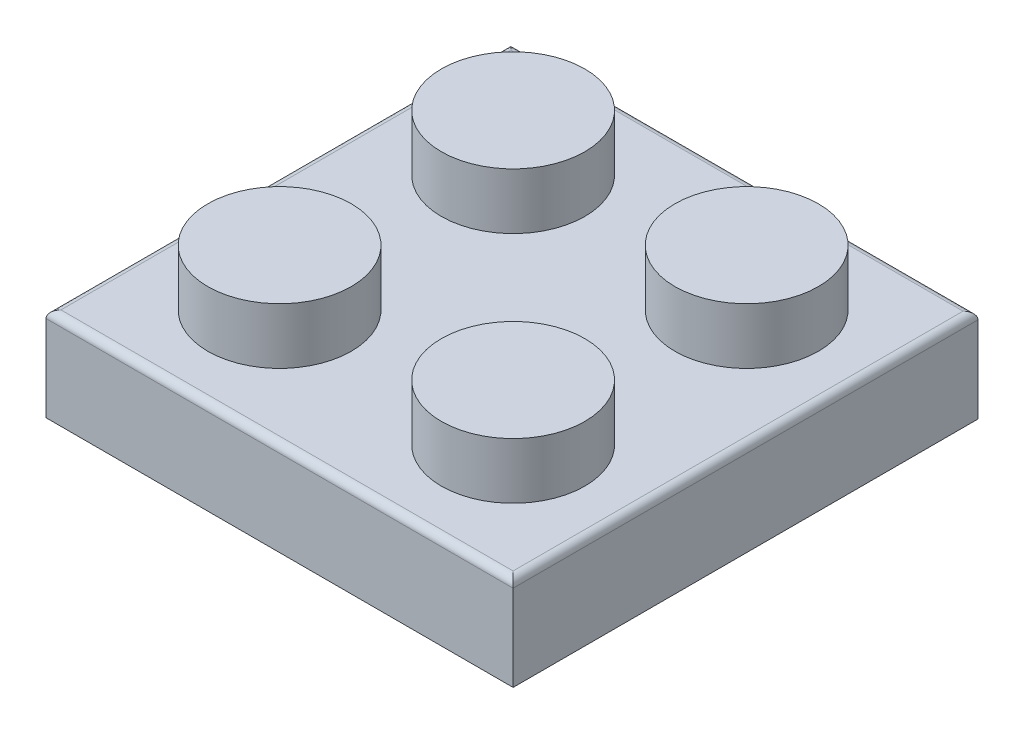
ISO-10303-21;
HEADER;
FILE_DESCRIPTION(('STEP AP214'),'2;1');
FILE_NAME('part.step','',(''),(''),'','','');
FILE_SCHEMA(('AUTOMOTIVE_DESIGN { 1 0 10303 214 1 1 1 1 }'));
ENDSEC;
DATA;
#1=APPLICATION_CONTEXT('core data for automotive mechanical design processes');
#2=APPLICATION_PROTOCOL_DEFINITION('international standard','automotive_design',2000,#1);
#3=PRODUCT_CONTEXT('',#1,'mechanical');
#4=PRODUCT('Part','Part','',(#3));
#5=PRODUCT_RELATED_PRODUCT_CATEGORY('part','',(#4));
#6=PRODUCT_DEFINITION_FORMATION('','',#4);
#7=PRODUCT_DEFINITION_CONTEXT('part definition',#1,'design');
#8=PRODUCT_DEFINITION('design','',#6,#7);
#9=PRODUCT_DEFINITION_SHAPE('','',#8);
#10=(LENGTH_UNIT() NAMED_UNIT(*) SI_UNIT(.MILLI.,.METRE.));
#11=(NAMED_UNIT(*) PLANE_ANGLE_UNIT() SI_UNIT($,.RADIAN.));
#12=(NAMED_UNIT(*) SI_UNIT($,.STERADIAN.) SOLID_ANGLE_UNIT());
#13=UNCERTAINTY_MEASURE_WITH_UNIT(LENGTH_MEASURE(1.E-05),#10,'distance_accuracy_value','');
#14=(GEOMETRIC_REPRESENTATION_CONTEXT(3) GLOBAL_UNCERTAINTY_ASSIGNED_CONTEXT((#13)) GLOBAL_UNIT_ASSIGNED_CONTEXT((#10,
#11,#12)) REPRESENTATION_CONTEXT('',''));
#15=CARTESIAN_POINT('',(0.,0.,0.));
#16=DIRECTION('',(0.,0.,1.));
#17=DIRECTION('',(1.,0.,0.));
#18=AXIS2_PLACEMENT_3D('',#15,#16,#17);
#19=CARTESIAN_POINT('',(-7.9375,1.5875,7.9));
#20=DIRECTION('',(0.,-1.,0.));
#21=DIRECTION('',(0.,0.,-1.));
#22=AXIS2_PLACEMENT_3D('',#19,#20,#21);
#23=PLANE('',#22);
#24=CARTESIAN_POINT('',(-3.96875,1.5875,3.93125));
#25=DIRECTION('',(0.,-1.,0.));
#26=DIRECTION('',(0.,0.,-1.));
#27=AXIS2_PLACEMENT_3D('',#24,#25,#26);
#28=CIRCLE('',#27,0.8509);
#29=CARTESIAN_POINT('',(-3.96875,1.5875,3.08035));
#30=VERTEX_POINT('',#29);
#31=EDGE_CURVE('E138',#30,#30,#28,.F.);
#32=ORIENTED_EDGE('',*,*,#31,.T.);
#33=EDGE_LOOP('',(#32));
#34=FACE_BOUND('',#33,.T.);
#35=DIRECTION('',(0.,0.,1.));
#36=VECTOR('',#35,1.);
#37=CARTESIAN_POINT('',(-6.35,1.5875,7.9));
#38=LINE('',#37,#36);
#39=CARTESIAN_POINT('',(-6.35,1.5875,-6.3125));
#40=VERTEX_POINT('',#39);
#41=CARTESIAN_POINT('',(-6.35,1.5875,6.3125));
#42=VERTEX_POINT('',#41);
#43=EDGE_CURVE('E117',#40,#42,#38,.T.);
#44=ORIENTED_EDGE('',*,*,#43,.F.);
#45=DIRECTION('',(1.,0.,0.));
#46=VECTOR('',#45,1.);
#47=CARTESIAN_POINT('',(-7.9375,1.5875,-6.3125));
#48=LINE('',#47,#46);
#49=CARTESIAN_POINT('',(6.35,1.5875,-6.3125));
#50=VERTEX_POINT('',#49);
#51=EDGE_CURVE('E145',#40,#50,#48,.T.);
#52=ORIENTED_EDGE('',*,*,#51,.T.);
#53=DIRECTION('',(0.,0.,-1.));
#54=VECTOR('',#53,1.);
#55=CARTESIAN_POINT('',(6.35,1.5875,7.9));
#56=LINE('',#55,#54);
#57=CARTESIAN_POINT('',(6.35,1.5875,6.3125));
#58=VERTEX_POINT('',#57);
#59=EDGE_CURVE('E143',#58,#50,#56,.T.);
#60=ORIENTED_EDGE('',*,*,#59,.F.);
#61=DIRECTION('',(-1.,0.,0.));
#62=VECTOR('',#61,1.);
#63=CARTESIAN_POINT('',(-7.9375,1.5875,6.3125));
#64=LINE('',#63,#62);
#65=EDGE_CURVE('E128',#58,#42,#64,.T.);
#66=ORIENTED_EDGE('',*,*,#65,.T.);
#67=EDGE_LOOP('',(#44,#52,#60,#66));
#68=FACE_BOUND('',#67,.T.);
#69=CARTESIAN_POINT('',(3.96875,1.5875,3.93125));
#70=DIRECTION('',(0.,-1.,0.));
#71=DIRECTION('',(0.,0.,-1.));
#72=AXIS2_PLACEMENT_3D('',#69,#70,#71);
#73=CIRCLE('',#72,0.8509);
#74=CARTESIAN_POINT('',(3.96875,1.5875,3.08035));
#75=VERTEX_POINT('',#74);
#76=EDGE_CURVE('E150',#75,#75,#73,.F.);
#77=ORIENTED_EDGE('',*,*,#76,.T.);
#78=EDGE_LOOP('',(#77));
#79=FACE_BOUND('',#78,.T.);
#80=CARTESIAN_POINT('',(-3.96875,1.5875,-4.00625));
#81=DIRECTION('',(0.,-1.,0.));
#82=DIRECTION('',(0.,0.,-1.));
#83=AXIS2_PLACEMENT_3D('',#80,#81,#82);
#84=CIRCLE('',#83,0.8509);
#85=CARTESIAN_POINT('',(-3.96875,1.5875,-4.85715));
#86=VERTEX_POINT('',#85);
#87=EDGE_CURVE('E153',#86,#86,#84,.F.);
#88=ORIENTED_EDGE('',*,*,#87,.T.);
#89=EDGE_LOOP('',(#88));
#90=FACE_BOUND('',#89,.T.);
#91=CARTESIAN_POINT('',(3.96875,1.5875,-4.00625));
#92=DIRECTION('',(0.,-1.,0.));
#93=DIRECTION('',(0.,0.,-1.));
#94=AXIS2_PLACEMENT_3D('',#91,#92,#93);
#95=CIRCLE('',#94,0.8509);
#96=CARTESIAN_POINT('',(3.96875,1.5875,-4.85715));
#97=VERTEX_POINT('',#96);
#98=EDGE_CURVE('E157',#97,#97,#95,.F.);
#99=ORIENTED_EDGE('',*,*,#98,.T.);
#100=EDGE_LOOP('',(#99));
#101=FACE_BOUND('',#100,.T.);
#102=CARTESIAN_POINT('',(0.,1.5875,0.));
#103=DIRECTION('',(0.,-1.,0.));
#104=DIRECTION('',(1.,0.,0.));
#105=AXIS2_PLACEMENT_3D('',#102,#103,#104);
#106=CIRCLE('',#105,3.2004);
#107=CARTESIAN_POINT('',(3.2004,1.5875,0.));
#108=VERTEX_POINT('',#107);
#109=EDGE_CURVE('E260',#108,#108,#106,.T.);
#110=ORIENTED_EDGE('',*,*,#109,.F.);
#111=EDGE_LOOP('',(#110));
#112=FACE_BOUND('',#111,.T.);
#113=ADVANCED_FACE('F40',(#34,#68,#79,#90,#101,#112),#23,.T.);
#114=CARTESIAN_POINT('',(-7.9375,0.,7.9));
#115=DIRECTION('',(0.,-1.,0.));
#116=DIRECTION('',(0.,0.,-1.));
#117=AXIS2_PLACEMENT_3D('',#114,#115,#116);
#118=PLANE('',#117);
#119=DIRECTION('',(0.,0.,1.));
#120=VECTOR('',#119,1.);
#121=CARTESIAN_POINT('',(-7.9375,0.,-7.9));
#122=LINE('',#121,#120);
#123=CARTESIAN_POINT('',(-7.9375,0.,-7.9));
#124=VERTEX_POINT('',#123);
#125=CARTESIAN_POINT('',(-7.9375,0.,7.9));
#126=VERTEX_POINT('',#125);
#127=EDGE_CURVE('E190',#124,#126,#122,.T.);
#128=ORIENTED_EDGE('',*,*,#127,.F.);
#129=DIRECTION('',(1.,0.,0.));
#130=VECTOR('',#129,1.);
#131=CARTESIAN_POINT('',(-7.9375,0.,-7.9));
#132=LINE('',#131,#130);
#133=CARTESIAN_POINT('',(7.9375,0.,-7.9));
#134=VERTEX_POINT('',#133);
#135=EDGE_CURVE('E199',#124,#134,#132,.T.);
#136=ORIENTED_EDGE('',*,*,#135,.T.);
#137=DIRECTION('',(0.,0.,-1.));
#138=VECTOR('',#137,1.);
#139=CARTESIAN_POINT('',(7.9375,0.,7.9));
#140=LINE('',#139,#138);
#141=CARTESIAN_POINT('',(7.9375,0.,7.9));
#142=VERTEX_POINT('',#141);
#143=EDGE_CURVE('E196',#142,#134,#140,.T.);
#144=ORIENTED_EDGE('',*,*,#143,.F.);
#145=DIRECTION('',(-1.,0.,0.));
#146=VECTOR('',#145,1.);
#147=CARTESIAN_POINT('',(7.9375,0.,7.9));
#148=LINE('',#147,#146);
#149=EDGE_CURVE('E193',#142,#126,#148,.T.);
#150=ORIENTED_EDGE('',*,*,#149,.T.);
#151=EDGE_LOOP('',(#128,#136,#144,#150));
#152=FACE_BOUND('',#151,.T.);
#153=DIRECTION('',(1.,0.,0.));
#154=VECTOR('',#153,1.);
#155=CARTESIAN_POINT('',(-7.9375,0.,-6.3125));
#156=LINE('',#155,#154);
#157=CARTESIAN_POINT('',(-6.35,0.,-6.3125));
#158=VERTEX_POINT('',#157);
#159=CARTESIAN_POINT('',(6.35,0.,-6.3125));
#160=VERTEX_POINT('',#159);
#161=EDGE_CURVE('E129',#158,#160,#156,.T.);
#162=ORIENTED_EDGE('',*,*,#161,.F.);
#163=DIRECTION('',(0.,0.,1.));
#164=VECTOR('',#163,1.);
#165=CARTESIAN_POINT('',(-6.35,0.,7.9));
#166=LINE('',#165,#164);
#167=CARTESIAN_POINT('',(-6.35,0.,6.3125));
#168=VERTEX_POINT('',#167);
#169=EDGE_CURVE('E168',#158,#168,#166,.T.);
#170=ORIENTED_EDGE('',*,*,#169,.T.);
#171=DIRECTION('',(-1.,0.,0.));
#172=VECTOR('',#171,1.);
#173=CARTESIAN_POINT('',(-7.9375,0.,6.3125));
#174=LINE('',#173,#172);
#175=CARTESIAN_POINT('',(6.35,0.,6.3125));
#176=VERTEX_POINT('',#175);
#177=EDGE_CURVE('E136',#176,#168,#174,.T.);
#178=ORIENTED_EDGE('',*,*,#177,.F.);
#179=DIRECTION('',(0.,0.,-1.));
#180=VECTOR('',#179,1.);
#181=CARTESIAN_POINT('',(6.35,0.,7.9));
#182=LINE('',#181,#180);
#183=EDGE_CURVE('E181',#176,#160,#182,.T.);
#184=ORIENTED_EDGE('',*,*,#183,.T.);
#185=EDGE_LOOP('',(#162,#170,#178,#184));
#186=FACE_BOUND('',#185,.T.);
#187=ADVANCED_FACE('F289',(#152,#186),#118,.T.);
#188=CARTESIAN_POINT('',(-7.9375,3.175,7.9));
#189=DIRECTION('',(0.,-1.,0.));
#190=DIRECTION('',(0.,0.,-1.));
#191=AXIS2_PLACEMENT_3D('',#188,#189,#190);
#192=PLANE('',#191);
#193=DIRECTION('',(0.,0.,-1.));
#194=VECTOR('',#193,1.);
#195=CARTESIAN_POINT('',(7.6835,3.175,7.9));
#196=LINE('',#195,#194);
#197=CARTESIAN_POINT('',(7.6835,3.175,7.646));
#198=VERTEX_POINT('',#197);
#199=CARTESIAN_POINT('',(7.6835,3.175,-7.646));
#200=VERTEX_POINT('',#199);
#201=EDGE_CURVE('E238',#198,#200,#196,.T.);
#202=ORIENTED_EDGE('',*,*,#201,.T.);
#203=DIRECTION('',(1.,0.,0.));
#204=VECTOR('',#203,1.);
#205=CARTESIAN_POINT('',(-7.9375,3.175,-7.646));
#206=LINE('',#205,#204);
#207=CARTESIAN_POINT('',(-7.6835,3.175,-7.646));
#208=VERTEX_POINT('',#207);
#209=EDGE_CURVE('E240',#200,#208,#206,.F.);
#210=ORIENTED_EDGE('',*,*,#209,.T.);
#211=DIRECTION('',(0.,0.,1.));
#212=VECTOR('',#211,1.);
#213=CARTESIAN_POINT('',(-7.6835,3.175,7.9));
#214=LINE('',#213,#212);
#215=CARTESIAN_POINT('',(-7.6835,3.175,7.646));
#216=VERTEX_POINT('',#215);
#217=EDGE_CURVE('E234',#208,#216,#214,.T.);
#218=ORIENTED_EDGE('',*,*,#217,.T.);
#219=DIRECTION('',(-1.,0.,0.));
#220=VECTOR('',#219,1.);
#221=CARTESIAN_POINT('',(7.9375,3.175,7.646));
#222=LINE('',#221,#220);
#223=EDGE_CURVE('E236',#216,#198,#222,.F.);
#224=ORIENTED_EDGE('',*,*,#223,.T.);
#225=EDGE_LOOP('',(#202,#210,#218,#224));
#226=FACE_BOUND('',#225,.T.);
#227=CARTESIAN_POINT('',(-3.96875,3.175,3.93125));
#228=DIRECTION('',(0.,-1.,0.));
#229=DIRECTION('',(0.,0.,-1.));
#230=AXIS2_PLACEMENT_3D('',#227,#228,#229);
#231=CIRCLE('',#230,2.4384);
#232=CARTESIAN_POINT('',(-3.96875,3.175,1.49285));
#233=VERTEX_POINT('',#232);
#234=EDGE_CURVE('E210',#233,#233,#231,.F.);
#235=ORIENTED_EDGE('',*,*,#234,.F.);
#236=EDGE_LOOP('',(#235));
#237=FACE_BOUND('',#236,.T.);
#238=CARTESIAN_POINT('',(3.96875,3.175,3.93125));
#239=DIRECTION('',(0.,-1.,0.));
#240=DIRECTION('',(0.,0.,-1.));
#241=AXIS2_PLACEMENT_3D('',#238,#239,#240);
#242=CIRCLE('',#241,2.4384);
#243=CARTESIAN_POINT('',(3.96875,3.175,1.49285));
#244=VERTEX_POINT('',#243);
#245=EDGE_CURVE('E213',#244,#244,#242,.F.);
#246=ORIENTED_EDGE('',*,*,#245,.F.);
#247=EDGE_LOOP('',(#246));
#248=FACE_BOUND('',#247,.T.);
#249=CARTESIAN_POINT('',(-3.96875,3.175,-4.00625));
#250=DIRECTION('',(0.,-1.,0.));
#251=DIRECTION('',(0.,0.,-1.));
#252=AXIS2_PLACEMENT_3D('',#249,#250,#251);
#253=CIRCLE('',#252,2.4384);
#254=CARTESIAN_POINT('',(-3.96875,3.175,-6.44465));
#255=VERTEX_POINT('',#254);
#256=EDGE_CURVE('E216',#255,#255,#253,.F.);
#257=ORIENTED_EDGE('',*,*,#256,.F.);
#258=EDGE_LOOP('',(#257));
#259=FACE_BOUND('',#258,.T.);
#260=CARTESIAN_POINT('',(3.96875,3.175,-4.00625));
#261=DIRECTION('',(0.,-1.,0.));
#262=DIRECTION('',(0.,0.,-1.));
#263=AXIS2_PLACEMENT_3D('',#260,#261,#262);
#264=CIRCLE('',#263,2.4384);
#265=CARTESIAN_POINT('',(3.96875,3.175,-6.44465));
#266=VERTEX_POINT('',#265);
#267=EDGE_CURVE('E222',#266,#266,#264,.F.);
#268=ORIENTED_EDGE('',*,*,#267,.F.);
#269=EDGE_LOOP('',(#268));
#270=FACE_BOUND('',#269,.T.);
#271=ADVANCED_FACE('F295',(#226,#237,#248,#259,#270),#192,.F.);
#272=CARTESIAN_POINT('',(-7.9375,3.175,-7.9));
#273=DIRECTION('',(1.,0.,0.));
#274=DIRECTION('',(0.,0.,-1.));
#275=AXIS2_PLACEMENT_3D('',#272,#273,#274);
#276=PLANE('',#275);
#277=DIRECTION('',(0.,-1.,0.));
#278=VECTOR('',#277,1.);
#279=CARTESIAN_POINT('',(-7.9375,3.175,7.9));
#280=LINE('',#279,#278);
#281=CARTESIAN_POINT('',(-7.9375,2.921,7.9));
#282=VERTEX_POINT('',#281);
#283=EDGE_CURVE('E208',#282,#126,#280,.T.);
#284=ORIENTED_EDGE('',*,*,#283,.F.);
#285=DIRECTION('',(0.,0.,1.));
#286=VECTOR('',#285,1.);
#287=CARTESIAN_POINT('',(-7.9375,2.921,-7.9));
#288=LINE('',#287,#286);
#289=CARTESIAN_POINT('',(-7.9375,2.921,-7.9));
#290=VERTEX_POINT('',#289);
#291=EDGE_CURVE('E11',#282,#290,#288,.F.);
#292=ORIENTED_EDGE('',*,*,#291,.T.);
#293=DIRECTION('',(0.,-1.,0.));
#294=VECTOR('',#293,1.);
#295=CARTESIAN_POINT('',(-7.9375,3.175,-7.9));
#296=LINE('',#295,#294);
#297=EDGE_CURVE('E202',#290,#124,#296,.T.);
#298=ORIENTED_EDGE('',*,*,#297,.T.);
#299=ORIENTED_EDGE('',*,*,#127,.T.);
#300=EDGE_LOOP('',(#284,#292,#298,#299));
#301=FACE_BOUND('',#300,.T.);
#302=ADVANCED_FACE('F362',(#301),#276,.F.);
#303=CARTESIAN_POINT('',(7.9375,3.175,7.9));
#304=DIRECTION('',(0.,0.,1.));
#305=DIRECTION('',(1.,0.,0.));
#306=AXIS2_PLACEMENT_3D('',#303,#304,#305);
#307=PLANE('',#306);
#308=DIRECTION('',(0.,-1.,0.));
#309=VECTOR('',#308,1.);
#310=CARTESIAN_POINT('',(7.9375,3.175,7.9));
#311=LINE('',#310,#309);
#312=CARTESIAN_POINT('',(7.9375,2.921,7.9));
#313=VERTEX_POINT('',#312);
#314=EDGE_CURVE('E206',#313,#142,#311,.T.);
#315=ORIENTED_EDGE('',*,*,#314,.F.);
#316=DIRECTION('',(-1.,0.,0.));
#317=VECTOR('',#316,1.);
#318=CARTESIAN_POINT('',(-7.9375,2.921,7.9));
#319=LINE('',#318,#317);
#320=EDGE_CURVE('E49',#313,#282,#319,.T.);
#321=ORIENTED_EDGE('',*,*,#320,.T.);
#322=ORIENTED_EDGE('',*,*,#283,.T.);
#323=ORIENTED_EDGE('',*,*,#149,.F.);
#324=EDGE_LOOP('',(#315,#321,#322,#323));
#325=FACE_BOUND('',#324,.T.);
#326=ADVANCED_FACE('F371',(#325),#307,.T.);
#327=CARTESIAN_POINT('',(7.9375,3.175,7.9));
#328=DIRECTION('',(-1.,0.,0.));
#329=DIRECTION('',(0.,0.,1.));
#330=AXIS2_PLACEMENT_3D('',#327,#328,#329);
#331=PLANE('',#330);
#332=DIRECTION('',(0.,-1.,0.));
#333=VECTOR('',#332,1.);
#334=CARTESIAN_POINT('',(7.9375,3.175,-7.9));
#335=LINE('',#334,#333);
#336=CARTESIAN_POINT('',(7.9375,2.921,-7.9));
#337=VERTEX_POINT('',#336);
#338=EDGE_CURVE('E204',#337,#134,#335,.T.);
#339=ORIENTED_EDGE('',*,*,#338,.F.);
#340=DIRECTION('',(0.,0.,-1.));
#341=VECTOR('',#340,1.);
#342=CARTESIAN_POINT('',(7.9375,2.921,7.9));
#343=LINE('',#342,#341);
#344=EDGE_CURVE('E64',#337,#313,#343,.F.);
#345=ORIENTED_EDGE('',*,*,#344,.T.);
#346=ORIENTED_EDGE('',*,*,#314,.T.);
#347=ORIENTED_EDGE('',*,*,#143,.T.);
#348=EDGE_LOOP('',(#339,#345,#346,#347));
#349=FACE_BOUND('',#348,.T.);
#350=ADVANCED_FACE('F367',(#349),#331,.F.);
#351=CARTESIAN_POINT('',(-7.9375,3.175,-7.9));
#352=DIRECTION('',(0.,0.,-1.));
#353=DIRECTION('',(-1.,0.,0.));
#354=AXIS2_PLACEMENT_3D('',#351,#352,#353);
#355=PLANE('',#354);
#356=ORIENTED_EDGE('',*,*,#297,.F.);
#357=DIRECTION('',(1.,0.,0.));
#358=VECTOR('',#357,1.);
#359=CARTESIAN_POINT('',(7.9375,2.921,-7.9));
#360=LINE('',#359,#358);
#361=EDGE_CURVE('E231',#290,#337,#360,.T.);
#362=ORIENTED_EDGE('',*,*,#361,.T.);
#363=ORIENTED_EDGE('',*,*,#338,.T.);
#364=ORIENTED_EDGE('',*,*,#135,.F.);
#365=EDGE_LOOP('',(#356,#362,#363,#364));
#366=FACE_BOUND('',#365,.T.);
#367=ADVANCED_FACE('F359',(#366),#355,.T.);
#368=CARTESIAN_POINT('',(-3.96875,5.08,3.93125));
#369=DIRECTION('',(0.,-1.,0.));
#370=DIRECTION('',(0.,0.,-1.));
#371=AXIS2_PLACEMENT_3D('',#368,#369,#370);
#372=CYLINDRICAL_SURFACE('',#371,2.4384);
#373=CARTESIAN_POINT('',(-3.96875,5.08,3.93125));
#374=DIRECTION('',(0.,1.,0.));
#375=DIRECTION('',(0.,0.,1.));
#376=AXIS2_PLACEMENT_3D('',#373,#374,#375);
#377=CIRCLE('',#376,2.4384);
#378=CARTESIAN_POINT('',(-3.96875,5.08,1.49285));
#379=VERTEX_POINT('',#378);
#380=EDGE_CURVE('E187',#379,#379,#377,.T.);
#381=CARTESIAN_POINT('',(-3.96875,5.08,1.49285));
#382=CARTESIAN_POINT('',(-3.96875,5.06015625,1.49285));
#383=CARTESIAN_POINT('',(-3.96875,5.0403125,1.49285));
#384=CARTESIAN_POINT('',(-3.96875,5.000625,1.49285));
#385=CARTESIAN_POINT('',(-3.96875,4.98078125,1.49285));
#386=CARTESIAN_POINT('',(-3.96875,4.94109375,1.49285));
#387=CARTESIAN_POINT('',(-3.96875,4.92125,1.49285));
#388=CARTESIAN_POINT('',(-3.96875,4.8815625,1.49285));
#389=CARTESIAN_POINT('',(-3.96875,4.86171875,1.49285));
#390=CARTESIAN_POINT('',(-3.96875,4.82203125,1.49285));
#391=CARTESIAN_POINT('',(-3.96875,4.8021875,1.49285));
#392=CARTESIAN_POINT('',(-3.96875,4.7625,1.49285));
#393=CARTESIAN_POINT('',(-3.96875,4.74265625,1.49285));
#394=CARTESIAN_POINT('',(-3.96875,4.70296875,1.49285));
#395=CARTESIAN_POINT('',(-3.96875,4.683125,1.49285));
#396=CARTESIAN_POINT('',(-3.96875,4.6434375,1.49285));
#397=CARTESIAN_POINT('',(-3.96875,4.62359375,1.49285));
#398=CARTESIAN_POINT('',(-3.96875,4.58390625,1.49285));
#399=CARTESIAN_POINT('',(-3.96875,4.5640625,1.49285));
#400=CARTESIAN_POINT('',(-3.96875,4.524375,1.49285));
#401=CARTESIAN_POINT('',(-3.96875,4.50453125,1.49285));
#402=CARTESIAN_POINT('',(-3.96875,4.46484375,1.49285));
#403=CARTESIAN_POINT('',(-3.96875,4.445,1.49285));
#404=CARTESIAN_POINT('',(-3.96875,4.4053125,1.49285));
#405=CARTESIAN_POINT('',(-3.96875,4.38546875,1.49285));
#406=CARTESIAN_POINT('',(-3.96875,4.34578125,1.49285));
#407=CARTESIAN_POINT('',(-3.96875,4.3259375,1.49285));
#408=CARTESIAN_POINT('',(-3.96875,4.28625,1.49285));
#409=CARTESIAN_POINT('',(-3.96875,4.26640625,1.49285));
#410=CARTESIAN_POINT('',(-3.96875,4.22671875,1.49285));
#411=CARTESIAN_POINT('',(-3.96875,4.206875,1.49285));
#412=CARTESIAN_POINT('',(-3.96875,4.1671875,1.49285));
#413=CARTESIAN_POINT('',(-3.96875,4.14734375,1.49285));
#414=CARTESIAN_POINT('',(-3.96875,4.10765625,1.49285));
#415=CARTESIAN_POINT('',(-3.96875,4.0878125,1.49285));
#416=CARTESIAN_POINT('',(-3.96875,4.048125,1.49285));
#417=CARTESIAN_POINT('',(-3.96875,4.02828125,1.49285));
#418=CARTESIAN_POINT('',(-3.96875,3.98859375,1.49285));
#419=CARTESIAN_POINT('',(-3.96875,3.96875,1.49285));
#420=CARTESIAN_POINT('',(-3.96875,3.9290625,1.49285));
#421=CARTESIAN_POINT('',(-3.96875,3.90921875,1.49285));
#422=CARTESIAN_POINT('',(-3.96875,3.86953125,1.49285));
#423=CARTESIAN_POINT('',(-3.96875,3.8496875,1.49285));
#424=CARTESIAN_POINT('',(-3.96875,3.81,1.49285));
#425=CARTESIAN_POINT('',(-3.96875,3.79015625,1.49285));
#426=CARTESIAN_POINT('',(-3.96875,3.75046875,1.49285));
#427=CARTESIAN_POINT('',(-3.96875,3.730625,1.49285));
#428=CARTESIAN_POINT('',(-3.96875,3.6909375,1.49285));
#429=CARTESIAN_POINT('',(-3.96875,3.67109375,1.49285));
#430=CARTESIAN_POINT('',(-3.96875,3.63140625,1.49285));
#431=CARTESIAN_POINT('',(-3.96875,3.6115625,1.49285));
#432=CARTESIAN_POINT('',(-3.96875,3.571875,1.49285));
#433=CARTESIAN_POINT('',(-3.96875,3.55203125,1.49285));
#434=CARTESIAN_POINT('',(-3.96875,3.51234375,1.49285));
#435=CARTESIAN_POINT('',(-3.96875,3.4925,1.49285));
#436=CARTESIAN_POINT('',(-3.96875,3.4528125,1.49285));
#437=CARTESIAN_POINT('',(-3.96875,3.43296875,1.49285));
#438=CARTESIAN_POINT('',(-3.96875,3.39328125,1.49285));
#439=CARTESIAN_POINT('',(-3.96875,3.3734375,1.49285));
#440=CARTESIAN_POINT('',(-3.96875,3.33375,1.49285));
#441=CARTESIAN_POINT('',(-3.96875,3.31390625,1.49285));
#442=CARTESIAN_POINT('',(-3.96875,3.27421875,1.49285));
#443=CARTESIAN_POINT('',(-3.96875,3.254375,1.49285));
#444=CARTESIAN_POINT('',(-3.96875,3.2146875,1.49285));
#445=CARTESIAN_POINT('',(-3.96875,3.19484375,1.49285));
#446=CARTESIAN_POINT('',(-3.96875,3.175,1.49285));
#447=B_SPLINE_CURVE_WITH_KNOTS('',3,(#381,#382,#383,#384,#385,#386,#387,#388,#389,#390,#391,
#392,#393,#394,#395,#396,#397,#398,#399,#400,#401,#402,#403,#404,#405,#406,#407,#408,#409,#410,
#411,#412,#413,#414,#415,#416,#417,#418,#419,#420,#421,#422,#423,#424,#425,#426,#427,#428,#429,
#430,#431,#432,#433,#434,#435,#436,#437,#438,#439,#440,#441,#442,#443,#444,#445,#446),
.UNSPECIFIED.,.F.,.F.,(4,2,2,2,2,2,2,2,2,2,2,2,2,2,2,2,2,2,2,2,2,2,2,2,2,2,2,2,2,2,2,2,4),(0.,
0.0595312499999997,0.119062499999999,0.178593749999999,0.238125,0.297656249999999,
0.357187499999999,0.41671875,0.476249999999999,0.535781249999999,0.595312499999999,
0.654843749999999,0.714374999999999,0.773906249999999,0.833437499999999,0.892968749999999,
0.952499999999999,1.01203125,1.0715625,1.13109375,1.190625,1.25015625,1.3096875,1.36921875,
1.42875,1.48828125,1.5478125,1.60734375,1.666875,1.72640625,1.7859375,1.84546875,1.905),.UNSPECIFIED.);
#448=EDGE_CURVE('BSEAM355',#379,#233,#447,.T.);
#449=ORIENTED_EDGE('',*,*,#380,.F.);
#450=ORIENTED_EDGE('',*,*,#234,.T.);
#451=ORIENTED_EDGE('',*,*,#448,.T.);
#452=ORIENTED_EDGE('',*,*,#448,.F.);
#453=EDGE_LOOP('',(#449,#451,#450,#452));
#454=FACE_BOUND('',#453,.T.);
#455=ADVANCED_FACE('F355',(#454),#372,.T.);
#456=CARTESIAN_POINT('',(-3.96875,5.08,3.93125));
#457=DIRECTION('',(0.,1.,0.));
#458=DIRECTION('',(0.,0.,1.));
#459=AXIS2_PLACEMENT_3D('',#456,#457,#458);
#460=PLANE('',#459);
#461=ORIENTED_EDGE('',*,*,#380,.T.);
#462=EDGE_LOOP('',(#461));
#463=FACE_BOUND('',#462,.T.);
#464=ADVANCED_FACE('F349',(#463),#460,.T.);
#465=CARTESIAN_POINT('',(3.96875,5.08,3.93125));
#466=DIRECTION('',(0.,-1.,0.));
#467=DIRECTION('',(0.,0.,-1.));
#468=AXIS2_PLACEMENT_3D('',#465,#466,#467);
#469=CYLINDRICAL_SURFACE('',#468,2.4384);
#470=CARTESIAN_POINT('',(3.96875,5.08,3.93125));
#471=DIRECTION('',(0.,1.,0.));
#472=DIRECTION('',(0.,0.,1.));
#473=AXIS2_PLACEMENT_3D('',#470,#471,#472);
#474=CIRCLE('',#473,2.4384);
#475=CARTESIAN_POINT('',(3.96875,5.08,1.49285));
#476=VERTEX_POINT('',#475);
#477=EDGE_CURVE('E177',#476,#476,#474,.T.);
#478=CARTESIAN_POINT('',(3.96875,5.08,1.49285));
#479=CARTESIAN_POINT('',(3.96875,5.06015625,1.49285));
#480=CARTESIAN_POINT('',(3.96875,5.0403125,1.49285));
#481=CARTESIAN_POINT('',(3.96875,5.000625,1.49285));
#482=CARTESIAN_POINT('',(3.96875,4.98078125,1.49285));
#483=CARTESIAN_POINT('',(3.96875,4.94109375,1.49285));
#484=CARTESIAN_POINT('',(3.96875,4.92125,1.49285));
#485=CARTESIAN_POINT('',(3.96875,4.8815625,1.49285));
#486=CARTESIAN_POINT('',(3.96875,4.86171875,1.49285));
#487=CARTESIAN_POINT('',(3.96875,4.82203125,1.49285));
#488=CARTESIAN_POINT('',(3.96875,4.8021875,1.49285));
#489=CARTESIAN_POINT('',(3.96875,4.7625,1.49285));
#490=CARTESIAN_POINT('',(3.96875,4.74265625,1.49285));
#491=CARTESIAN_POINT('',(3.96875,4.70296875,1.49285));
#492=CARTESIAN_POINT('',(3.96875,4.683125,1.49285));
#493=CARTESIAN_POINT('',(3.96875,4.6434375,1.49285));
#494=CARTESIAN_POINT('',(3.96875,4.62359375,1.49285));
#495=CARTESIAN_POINT('',(3.96875,4.58390625,1.49285));
#496=CARTESIAN_POINT('',(3.96875,4.5640625,1.49285));
#497=CARTESIAN_POINT('',(3.96875,4.524375,1.49285));
#498=CARTESIAN_POINT('',(3.96875,4.50453125,1.49285));
#499=CARTESIAN_POINT('',(3.96875,4.46484375,1.49285));
#500=CARTESIAN_POINT('',(3.96875,4.445,1.49285));
#501=CARTESIAN_POINT('',(3.96875,4.4053125,1.49285));
#502=CARTESIAN_POINT('',(3.96875,4.38546875,1.49285));
#503=CARTESIAN_POINT('',(3.96875,4.34578125,1.49285));
#504=CARTESIAN_POINT('',(3.96875,4.3259375,1.49285));
#505=CARTESIAN_POINT('',(3.96875,4.28625,1.49285));
#506=CARTESIAN_POINT('',(3.96875,4.26640625,1.49285));
#507=CARTESIAN_POINT('',(3.96875,4.22671875,1.49285));
#508=CARTESIAN_POINT('',(3.96875,4.206875,1.49285));
#509=CARTESIAN_POINT('',(3.96875,4.1671875,1.49285));
#510=CARTESIAN_POINT('',(3.96875,4.14734375,1.49285));
#511=CARTESIAN_POINT('',(3.96875,4.10765625,1.49285));
#512=CARTESIAN_POINT('',(3.96875,4.0878125,1.49285));
#513=CARTESIAN_POINT('',(3.96875,4.048125,1.49285));
#514=CARTESIAN_POINT('',(3.96875,4.02828125,1.49285));
#515=CARTESIAN_POINT('',(3.96875,3.98859375,1.49285));
#516=CARTESIAN_POINT('',(3.96875,3.96875,1.49285));
#517=CARTESIAN_POINT('',(3.96875,3.9290625,1.49285));
#518=CARTESIAN_POINT('',(3.96875,3.90921875,1.49285));
#519=CARTESIAN_POINT('',(3.96875,3.86953125,1.49285));
#520=CARTESIAN_POINT('',(3.96875,3.8496875,1.49285));
#521=CARTESIAN_POINT('',(3.96875,3.81,1.49285));
#522=CARTESIAN_POINT('',(3.96875,3.79015625,1.49285));
#523=CARTESIAN_POINT('',(3.96875,3.75046875,1.49285));
#524=CARTESIAN_POINT('',(3.96875,3.730625,1.49285));
#525=CARTESIAN_POINT('',(3.96875,3.6909375,1.49285));
#526=CARTESIAN_POINT('',(3.96875,3.67109375,1.49285));
#527=CARTESIAN_POINT('',(3.96875,3.63140625,1.49285));
#528=CARTESIAN_POINT('',(3.96875,3.6115625,1.49285));
#529=CARTESIAN_POINT('',(3.96875,3.571875,1.49285));
#530=CARTESIAN_POINT('',(3.96875,3.55203125,1.49285));
#531=CARTESIAN_POINT('',(3.96875,3.51234375,1.49285));
#532=CARTESIAN_POINT('',(3.96875,3.4925,1.49285));
#533=CARTESIAN_POINT('',(3.96875,3.4528125,1.49285));
#534=CARTESIAN_POINT('',(3.96875,3.43296875,1.49285));
#535=CARTESIAN_POINT('',(3.96875,3.39328125,1.49285));
#536=CARTESIAN_POINT('',(3.96875,3.3734375,1.49285));
#537=CARTESIAN_POINT('',(3.96875,3.33375,1.49285));
#538=CARTESIAN_POINT('',(3.96875,3.31390625,1.49285));
#539=CARTESIAN_POINT('',(3.96875,3.27421875,1.49285));
#540=CARTESIAN_POINT('',(3.96875,3.254375,1.49285));
#541=CARTESIAN_POINT('',(3.96875,3.2146875,1.49285));
#542=CARTESIAN_POINT('',(3.96875,3.19484375,1.49285));
#543=CARTESIAN_POINT('',(3.96875,3.175,1.49285));
#544=B_SPLINE_CURVE_WITH_KNOTS('',3,(#478,#479,#480,#481,#482,#483,#484,#485,#486,#487,#488,
#489,#490,#491,#492,#493,#494,#495,#496,#497,#498,#499,#500,#501,#502,#503,#504,#505,#506,#507,
#508,#509,#510,#511,#512,#513,#514,#515,#516,#517,#518,#519,#520,#521,#522,#523,#524,#525,#526,
#527,#528,#529,#530,#531,#532,#533,#534,#535,#536,#537,#538,#539,#540,#541,#542,#543),
.UNSPECIFIED.,.F.,.F.,(4,2,2,2,2,2,2,2,2,2,2,2,2,2,2,2,2,2,2,2,2,2,2,2,2,2,2,2,2,2,2,2,4),(0.,
0.0595312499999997,0.119062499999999,0.178593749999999,0.238125,0.297656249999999,
0.357187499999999,0.41671875,0.476249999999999,0.535781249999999,0.595312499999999,
0.654843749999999,0.714374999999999,0.773906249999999,0.833437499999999,0.892968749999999,
0.952499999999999,1.01203125,1.0715625,1.13109375,1.190625,1.25015625,1.3096875,1.36921875,
1.42875,1.48828125,1.5478125,1.60734375,1.666875,1.72640625,1.7859375,1.84546875,1.905),.UNSPECIFIED.);
#545=EDGE_CURVE('BSEAM347',#476,#244,#544,.T.);
#546=ORIENTED_EDGE('',*,*,#477,.F.);
#547=ORIENTED_EDGE('',*,*,#245,.T.);
#548=ORIENTED_EDGE('',*,*,#545,.T.);
#549=ORIENTED_EDGE('',*,*,#545,.F.);
#550=EDGE_LOOP('',(#546,#548,#547,#549));
#551=FACE_BOUND('',#550,.T.);
#552=ADVANCED_FACE('F347',(#551),#469,.T.);
#553=CARTESIAN_POINT('',(3.96875,5.08,3.93125));
#554=DIRECTION('',(0.,1.,0.));
#555=DIRECTION('',(0.,0.,1.));
#556=AXIS2_PLACEMENT_3D('',#553,#554,#555);
#557=PLANE('',#556);
#558=ORIENTED_EDGE('',*,*,#477,.T.);
#559=EDGE_LOOP('',(#558));
#560=FACE_BOUND('',#559,.T.);
#561=ADVANCED_FACE('F343',(#560),#557,.T.);
#562=CARTESIAN_POINT('',(-3.96875,5.08,-4.00625));
#563=DIRECTION('',(0.,1.,0.));
#564=DIRECTION('',(0.,0.,1.));
#565=AXIS2_PLACEMENT_3D('',#562,#563,#564);
#566=PLANE('',#565);
#567=CARTESIAN_POINT('',(-3.96875,5.08,-4.00625));
#568=DIRECTION('',(0.,1.,0.));
#569=DIRECTION('',(0.,0.,1.));
#570=AXIS2_PLACEMENT_3D('',#567,#568,#569);
#571=CIRCLE('',#570,2.4384);
#572=CARTESIAN_POINT('',(-3.96875,5.08,-6.44465));
#573=VERTEX_POINT('',#572);
#574=EDGE_CURVE('E219',#573,#573,#571,.T.);
#575=ORIENTED_EDGE('',*,*,#574,.T.);
#576=EDGE_LOOP('',(#575));
#577=FACE_BOUND('',#576,.T.);
#578=ADVANCED_FACE('F346',(#577),#566,.T.);
#579=CARTESIAN_POINT('',(-3.96875,5.08,-4.00625));
#580=DIRECTION('',(0.,-1.,0.));
#581=DIRECTION('',(0.,0.,-1.));
#582=AXIS2_PLACEMENT_3D('',#579,#580,#581);
#583=CYLINDRICAL_SURFACE('',#582,2.4384);
#584=CARTESIAN_POINT('',(-3.96875,5.08,-6.44465));
#585=CARTESIAN_POINT('',(-3.96875,5.06015625,-6.44465));
#586=CARTESIAN_POINT('',(-3.96875,5.0403125,-6.44465));
#587=CARTESIAN_POINT('',(-3.96875,5.000625,-6.44465));
#588=CARTESIAN_POINT('',(-3.96875,4.98078125,-6.44465));
#589=CARTESIAN_POINT('',(-3.96875,4.94109375,-6.44465));
#590=CARTESIAN_POINT('',(-3.96875,4.92125,-6.44465));
#591=CARTESIAN_POINT('',(-3.96875,4.8815625,-6.44465));
#592=CARTESIAN_POINT('',(-3.96875,4.86171875,-6.44465));
#593=CARTESIAN_POINT('',(-3.96875,4.82203125,-6.44465));
#594=CARTESIAN_POINT('',(-3.96875,4.8021875,-6.44465));
#595=CARTESIAN_POINT('',(-3.96875,4.7625,-6.44465));
#596=CARTESIAN_POINT('',(-3.96875,4.74265625,-6.44465));
#597=CARTESIAN_POINT('',(-3.96875,4.70296875,-6.44465));
#598=CARTESIAN_POINT('',(-3.96875,4.683125,-6.44465));
#599=CARTESIAN_POINT('',(-3.96875,4.6434375,-6.44465));
#600=CARTESIAN_POINT('',(-3.96875,4.62359375,-6.44465));
#601=CARTESIAN_POINT('',(-3.96875,4.58390625,-6.44465));
#602=CARTESIAN_POINT('',(-3.96875,4.5640625,-6.44465));
#603=CARTESIAN_POINT('',(-3.96875,4.524375,-6.44465));
#604=CARTESIAN_POINT('',(-3.96875,4.50453125,-6.44465));
#605=CARTESIAN_POINT('',(-3.96875,4.46484375,-6.44465));
#606=CARTESIAN_POINT('',(-3.96875,4.445,-6.44465));
#607=CARTESIAN_POINT('',(-3.96875,4.4053125,-6.44465));
#608=CARTESIAN_POINT('',(-3.96875,4.38546875,-6.44465));
#609=CARTESIAN_POINT('',(-3.96875,4.34578125,-6.44465));
#610=CARTESIAN_POINT('',(-3.96875,4.3259375,-6.44465));
#611=CARTESIAN_POINT('',(-3.96875,4.28625,-6.44465));
#612=CARTESIAN_POINT('',(-3.96875,4.26640625,-6.44465));
#613=CARTESIAN_POINT('',(-3.96875,4.22671875,-6.44465));
#614=CARTESIAN_POINT('',(-3.96875,4.206875,-6.44465));
#615=CARTESIAN_POINT('',(-3.96875,4.1671875,-6.44465));
#616=CARTESIAN_POINT('',(-3.96875,4.14734375,-6.44465));
#617=CARTESIAN_POINT('',(-3.96875,4.10765625,-6.44465));
#618=CARTESIAN_POINT('',(-3.96875,4.0878125,-6.44465));
#619=CARTESIAN_POINT('',(-3.96875,4.048125,-6.44465));
#620=CARTESIAN_POINT('',(-3.96875,4.02828125,-6.44465));
#621=CARTESIAN_POINT('',(-3.96875,3.98859375,-6.44465));
#622=CARTESIAN_POINT('',(-3.96875,3.96875,-6.44465));
#623=CARTESIAN_POINT('',(-3.96875,3.9290625,-6.44465));
#624=CARTESIAN_POINT('',(-3.96875,3.90921875,-6.44465));
#625=CARTESIAN_POINT('',(-3.96875,3.86953125,-6.44465));
#626=CARTESIAN_POINT('',(-3.96875,3.8496875,-6.44465));
#627=CARTESIAN_POINT('',(-3.96875,3.81,-6.44465));
#628=CARTESIAN_POINT('',(-3.96875,3.79015625,-6.44465));
#629=CARTESIAN_POINT('',(-3.96875,3.75046875,-6.44465));
#630=CARTESIAN_POINT('',(-3.96875,3.730625,-6.44465));
#631=CARTESIAN_POINT('',(-3.96875,3.6909375,-6.44465));
#632=CARTESIAN_POINT('',(-3.96875,3.67109375,-6.44465));
#633=CARTESIAN_POINT('',(-3.96875,3.63140625,-6.44465));
#634=CARTESIAN_POINT('',(-3.96875,3.6115625,-6.44465));
#635=CARTESIAN_POINT('',(-3.96875,3.571875,-6.44465));
#636=CARTESIAN_POINT('',(-3.96875,3.55203125,-6.44465));
#637=CARTESIAN_POINT('',(-3.96875,3.51234375,-6.44465));
#638=CARTESIAN_POINT('',(-3.96875,3.4925,-6.44465));
#639=CARTESIAN_POINT('',(-3.96875,3.4528125,-6.44465));
#640=CARTESIAN_POINT('',(-3.96875,3.43296875,-6.44465));
#641=CARTESIAN_POINT('',(-3.96875,3.39328125,-6.44465));
#642=CARTESIAN_POINT('',(-3.96875,3.3734375,-6.44465));
#643=CARTESIAN_POINT('',(-3.96875,3.33375,-6.44465));
#644=CARTESIAN_POINT('',(-3.96875,3.31390625,-6.44465));
#645=CARTESIAN_POINT('',(-3.96875,3.27421875,-6.44465));
#646=CARTESIAN_POINT('',(-3.96875,3.254375,-6.44465));
#647=CARTESIAN_POINT('',(-3.96875,3.2146875,-6.44465));
#648=CARTESIAN_POINT('',(-3.96875,3.19484375,-6.44465));
#649=CARTESIAN_POINT('',(-3.96875,3.175,-6.44465));
#650=B_SPLINE_CURVE_WITH_KNOTS('',3,(#584,#585,#586,#587,#588,#589,#590,#591,#592,#593,#594,
#595,#596,#597,#598,#599,#600,#601,#602,#603,#604,#605,#606,#607,#608,#609,#610,#611,#612,#613,
#614,#615,#616,#617,#618,#619,#620,#621,#622,#623,#624,#625,#626,#627,#628,#629,#630,#631,#632,
#633,#634,#635,#636,#637,#638,#639,#640,#641,#642,#643,#644,#645,#646,#647,#648,#649),
.UNSPECIFIED.,.F.,.F.,(4,2,2,2,2,2,2,2,2,2,2,2,2,2,2,2,2,2,2,2,2,2,2,2,2,2,2,2,2,2,2,2,4),(0.,
0.0595312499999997,0.119062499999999,0.178593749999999,0.238125,0.297656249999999,
0.357187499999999,0.41671875,0.476249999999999,0.535781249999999,0.595312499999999,
0.654843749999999,0.714374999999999,0.773906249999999,0.833437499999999,0.892968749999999,
0.952499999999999,1.01203125,1.0715625,1.13109375,1.190625,1.25015625,1.3096875,1.36921875,
1.42875,1.48828125,1.5478125,1.60734375,1.666875,1.72640625,1.7859375,1.84546875,1.905),.UNSPECIFIED.);
#651=EDGE_CURVE('BSEAM377',#573,#255,#650,.T.);
#652=ORIENTED_EDGE('',*,*,#574,.F.);
#653=ORIENTED_EDGE('',*,*,#256,.T.);
#654=ORIENTED_EDGE('',*,*,#651,.T.);
#655=ORIENTED_EDGE('',*,*,#651,.F.);
#656=EDGE_LOOP('',(#652,#654,#653,#655));
#657=FACE_BOUND('',#656,.T.);
#658=ADVANCED_FACE('F377',(#657),#583,.T.);
#659=CARTESIAN_POINT('',(3.96875,5.08,-4.00625));
#660=DIRECTION('',(0.,1.,0.));
#661=DIRECTION('',(0.,0.,1.));
#662=AXIS2_PLACEMENT_3D('',#659,#660,#661);
#663=PLANE('',#662);
#664=CARTESIAN_POINT('',(3.96875,5.08,-4.00625));
#665=DIRECTION('',(0.,1.,0.));
#666=DIRECTION('',(0.,0.,1.));
#667=AXIS2_PLACEMENT_3D('',#664,#665,#666);
#668=CIRCLE('',#667,2.4384);
#669=CARTESIAN_POINT('',(3.96875,5.08,-6.44465));
#670=VERTEX_POINT('',#669);
#671=EDGE_CURVE('E225',#670,#670,#668,.T.);
#672=ORIENTED_EDGE('',*,*,#671,.T.);
#673=EDGE_LOOP('',(#672));
#674=FACE_BOUND('',#673,.T.);
#675=ADVANCED_FACE('F380',(#674),#663,.T.);
#676=CARTESIAN_POINT('',(3.96875,5.08,-4.00625));
#677=DIRECTION('',(0.,-1.,0.));
#678=DIRECTION('',(0.,0.,-1.));
#679=AXIS2_PLACEMENT_3D('',#676,#677,#678);
#680=CYLINDRICAL_SURFACE('',#679,2.4384);
#681=CARTESIAN_POINT('',(3.96875,5.08,-6.44465));
#682=CARTESIAN_POINT('',(3.96875,5.06015625,-6.44465));
#683=CARTESIAN_POINT('',(3.96875,5.0403125,-6.44465));
#684=CARTESIAN_POINT('',(3.96875,5.000625,-6.44465));
#685=CARTESIAN_POINT('',(3.96875,4.98078125,-6.44465));
#686=CARTESIAN_POINT('',(3.96875,4.94109375,-6.44465));
#687=CARTESIAN_POINT('',(3.96875,4.92125,-6.44465));
#688=CARTESIAN_POINT('',(3.96875,4.8815625,-6.44465));
#689=CARTESIAN_POINT('',(3.96875,4.86171875,-6.44465));
#690=CARTESIAN_POINT('',(3.96875,4.82203125,-6.44465));
#691=CARTESIAN_POINT('',(3.96875,4.8021875,-6.44465));
#692=CARTESIAN_POINT('',(3.96875,4.7625,-6.44465));
#693=CARTESIAN_POINT('',(3.96875,4.74265625,-6.44465));
#694=CARTESIAN_POINT('',(3.96875,4.70296875,-6.44465));
#695=CARTESIAN_POINT('',(3.96875,4.683125,-6.44465));
#696=CARTESIAN_POINT('',(3.96875,4.6434375,-6.44465));
#697=CARTESIAN_POINT('',(3.96875,4.62359375,-6.44465));
#698=CARTESIAN_POINT('',(3.96875,4.58390625,-6.44465));
#699=CARTESIAN_POINT('',(3.96875,4.5640625,-6.44465));
#700=CARTESIAN_POINT('',(3.96875,4.524375,-6.44465));
#701=CARTESIAN_POINT('',(3.96875,4.50453125,-6.44465));
#702=CARTESIAN_POINT('',(3.96875,4.46484375,-6.44465));
#703=CARTESIAN_POINT('',(3.96875,4.445,-6.44465));
#704=CARTESIAN_POINT('',(3.96875,4.4053125,-6.44465));
#705=CARTESIAN_POINT('',(3.96875,4.38546875,-6.44465));
#706=CARTESIAN_POINT('',(3.96875,4.34578125,-6.44465));
#707=CARTESIAN_POINT('',(3.96875,4.3259375,-6.44465));
#708=CARTESIAN_POINT('',(3.96875,4.28625,-6.44465));
#709=CARTESIAN_POINT('',(3.96875,4.26640625,-6.44465));
#710=CARTESIAN_POINT('',(3.96875,4.22671875,-6.44465));
#711=CARTESIAN_POINT('',(3.96875,4.206875,-6.44465));
#712=CARTESIAN_POINT('',(3.96875,4.1671875,-6.44465));
#713=CARTESIAN_POINT('',(3.96875,4.14734375,-6.44465));
#714=CARTESIAN_POINT('',(3.96875,4.10765625,-6.44465));
#715=CARTESIAN_POINT('',(3.96875,4.0878125,-6.44465));
#716=CARTESIAN_POINT('',(3.96875,4.048125,-6.44465));
#717=CARTESIAN_POINT('',(3.96875,4.02828125,-6.44465));
#718=CARTESIAN_POINT('',(3.96875,3.98859375,-6.44465));
#719=CARTESIAN_POINT('',(3.96875,3.96875,-6.44465));
#720=CARTESIAN_POINT('',(3.96875,3.9290625,-6.44465));
#721=CARTESIAN_POINT('',(3.96875,3.90921875,-6.44465));
#722=CARTESIAN_POINT('',(3.96875,3.86953125,-6.44465));
#723=CARTESIAN_POINT('',(3.96875,3.8496875,-6.44465));
#724=CARTESIAN_POINT('',(3.96875,3.81,-6.44465));
#725=CARTESIAN_POINT('',(3.96875,3.79015625,-6.44465));
#726=CARTESIAN_POINT('',(3.96875,3.75046875,-6.44465));
#727=CARTESIAN_POINT('',(3.96875,3.730625,-6.44465));
#728=CARTESIAN_POINT('',(3.96875,3.6909375,-6.44465));
#729=CARTESIAN_POINT('',(3.96875,3.67109375,-6.44465));
#730=CARTESIAN_POINT('',(3.96875,3.63140625,-6.44465));
#731=CARTESIAN_POINT('',(3.96875,3.6115625,-6.44465));
#732=CARTESIAN_POINT('',(3.96875,3.571875,-6.44465));
#733=CARTESIAN_POINT('',(3.96875,3.55203125,-6.44465));
#734=CARTESIAN_POINT('',(3.96875,3.51234375,-6.44465));
#735=CARTESIAN_POINT('',(3.96875,3.4925,-6.44465));
#736=CARTESIAN_POINT('',(3.96875,3.4528125,-6.44465));
#737=CARTESIAN_POINT('',(3.96875,3.43296875,-6.44465));
#738=CARTESIAN_POINT('',(3.96875,3.39328125,-6.44465));
#739=CARTESIAN_POINT('',(3.96875,3.3734375,-6.44465));
#740=CARTESIAN_POINT('',(3.96875,3.33375,-6.44465));
#741=CARTESIAN_POINT('',(3.96875,3.31390625,-6.44465));
#742=CARTESIAN_POINT('',(3.96875,3.27421875,-6.44465));
#743=CARTESIAN_POINT('',(3.96875,3.254375,-6.44465));
#744=CARTESIAN_POINT('',(3.96875,3.2146875,-6.44465));
#745=CARTESIAN_POINT('',(3.96875,3.19484375,-6.44465));
#746=CARTESIAN_POINT('',(3.96875,3.175,-6.44465));
#747=B_SPLINE_CURVE_WITH_KNOTS('',3,(#681,#682,#683,#684,#685,#686,#687,#688,#689,#690,#691,
#692,#693,#694,#695,#696,#697,#698,#699,#700,#701,#702,#703,#704,#705,#706,#707,#708,#709,#710,
#711,#712,#713,#714,#715,#716,#717,#718,#719,#720,#721,#722,#723,#724,#725,#726,#727,#728,#729,
#730,#731,#732,#733,#734,#735,#736,#737,#738,#739,#740,#741,#742,#743,#744,#745,#746),
.UNSPECIFIED.,.F.,.F.,(4,2,2,2,2,2,2,2,2,2,2,2,2,2,2,2,2,2,2,2,2,2,2,2,2,2,2,2,2,2,2,2,4),(0.,
0.0595312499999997,0.119062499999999,0.178593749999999,0.238125,0.297656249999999,
0.357187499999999,0.41671875,0.476249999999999,0.535781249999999,0.595312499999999,
0.654843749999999,0.714374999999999,0.773906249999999,0.833437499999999,0.892968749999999,
0.952499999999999,1.01203125,1.0715625,1.13109375,1.190625,1.25015625,1.3096875,1.36921875,
1.42875,1.48828125,1.5478125,1.60734375,1.666875,1.72640625,1.7859375,1.84546875,1.905),.UNSPECIFIED.);
#748=EDGE_CURVE('BSEAM385',#670,#266,#747,.T.);
#749=ORIENTED_EDGE('',*,*,#671,.F.);
#750=ORIENTED_EDGE('',*,*,#267,.T.);
#751=ORIENTED_EDGE('',*,*,#748,.T.);
#752=ORIENTED_EDGE('',*,*,#748,.F.);
#753=EDGE_LOOP('',(#749,#751,#750,#752));
#754=FACE_BOUND('',#753,.T.);
#755=ADVANCED_FACE('F385',(#754),#680,.T.);
#756=CARTESIAN_POINT('',(-6.35,3.175,-7.9));
#757=DIRECTION('',(1.,0.,0.));
#758=DIRECTION('',(0.,0.,-1.));
#759=AXIS2_PLACEMENT_3D('',#756,#757,#758);
#760=PLANE('',#759);
#761=ORIENTED_EDGE('',*,*,#169,.F.);
#762=DIRECTION('',(0.,-1.,0.));
#763=VECTOR('',#762,1.);
#764=CARTESIAN_POINT('',(-6.35,3.175,-6.3125));
#765=LINE('',#764,#763);
#766=EDGE_CURVE('E123',#40,#158,#765,.T.);
#767=ORIENTED_EDGE('',*,*,#766,.F.);
#768=ORIENTED_EDGE('',*,*,#43,.T.);
#769=DIRECTION('',(0.,-1.,0.));
#770=VECTOR('',#769,1.);
#771=CARTESIAN_POINT('',(-6.35,3.175,6.3125));
#772=LINE('',#771,#770);
#773=EDGE_CURVE('E121',#42,#168,#772,.T.);
#774=ORIENTED_EDGE('',*,*,#773,.T.);
#775=EDGE_LOOP('',(#761,#767,#768,#774));
#776=FACE_BOUND('',#775,.T.);
#777=ADVANCED_FACE('F120',(#776),#760,.T.);
#778=CARTESIAN_POINT('',(7.9375,3.175,6.3125));
#779=DIRECTION('',(0.,0.,1.));
#780=DIRECTION('',(1.,0.,0.));
#781=AXIS2_PLACEMENT_3D('',#778,#779,#780);
#782=PLANE('',#781);
#783=ORIENTED_EDGE('',*,*,#177,.T.);
#784=ORIENTED_EDGE('',*,*,#773,.F.);
#785=ORIENTED_EDGE('',*,*,#65,.F.);
#786=DIRECTION('',(0.,-1.,0.));
#787=VECTOR('',#786,1.);
#788=CARTESIAN_POINT('',(6.35,3.175,6.3125));
#789=LINE('',#788,#787);
#790=EDGE_CURVE('E139',#58,#176,#789,.T.);
#791=ORIENTED_EDGE('',*,*,#790,.T.);
#792=EDGE_LOOP('',(#783,#784,#785,#791));
#793=FACE_BOUND('',#792,.T.);
#794=ADVANCED_FACE('F133',(#793),#782,.F.);
#795=CARTESIAN_POINT('',(6.35,3.175,7.9));
#796=DIRECTION('',(-1.,0.,0.));
#797=DIRECTION('',(0.,0.,1.));
#798=AXIS2_PLACEMENT_3D('',#795,#796,#797);
#799=PLANE('',#798);
#800=ORIENTED_EDGE('',*,*,#183,.F.);
#801=ORIENTED_EDGE('',*,*,#790,.F.);
#802=ORIENTED_EDGE('',*,*,#59,.T.);
#803=DIRECTION('',(0.,-1.,0.));
#804=VECTOR('',#803,1.);
#805=CARTESIAN_POINT('',(6.35,3.175,-6.3125));
#806=LINE('',#805,#804);
#807=EDGE_CURVE('E162',#50,#160,#806,.T.);
#808=ORIENTED_EDGE('',*,*,#807,.T.);
#809=EDGE_LOOP('',(#800,#801,#802,#808));
#810=FACE_BOUND('',#809,.T.);
#811=ADVANCED_FACE('F285',(#810),#799,.T.);
#812=CARTESIAN_POINT('',(-7.9375,3.175,-6.3125));
#813=DIRECTION('',(0.,0.,-1.));
#814=DIRECTION('',(-1.,0.,0.));
#815=AXIS2_PLACEMENT_3D('',#812,#813,#814);
#816=PLANE('',#815);
#817=ORIENTED_EDGE('',*,*,#161,.T.);
#818=ORIENTED_EDGE('',*,*,#807,.F.);
#819=ORIENTED_EDGE('',*,*,#51,.F.);
#820=ORIENTED_EDGE('',*,*,#766,.T.);
#821=EDGE_LOOP('',(#817,#818,#819,#820));
#822=FACE_BOUND('',#821,.T.);
#823=ADVANCED_FACE('F274',(#822),#816,.F.);
#824=CARTESIAN_POINT('',(-3.96875,5.08,3.93125));
#825=DIRECTION('',(0.,-1.,0.));
#826=DIRECTION('',(0.,0.,-1.));
#827=AXIS2_PLACEMENT_3D('',#824,#825,#826);
#828=CYLINDRICAL_SURFACE('',#827,0.8509);
#829=CARTESIAN_POINT('',(-3.96875,3.4925,3.93125));
#830=DIRECTION('',(0.,1.,0.));
#831=DIRECTION('',(0.,0.,1.));
#832=AXIS2_PLACEMENT_3D('',#829,#830,#831);
#833=CIRCLE('',#832,0.8509);
#834=CARTESIAN_POINT('',(-3.96875,3.4925,3.08035));
#835=VERTEX_POINT('',#834);
#836=EDGE_CURVE('E165',#835,#835,#833,.T.);
#837=CARTESIAN_POINT('',(-3.96875,3.4925,3.08035));
#838=CARTESIAN_POINT('',(-3.96875,3.47265625,3.08035));
#839=CARTESIAN_POINT('',(-3.96875,3.4528125,3.08035));
#840=CARTESIAN_POINT('',(-3.96875,3.413125,3.08035));
#841=CARTESIAN_POINT('',(-3.96875,3.39328125,3.08035));
#842=CARTESIAN_POINT('',(-3.96875,3.35359375,3.08035));
#843=CARTESIAN_POINT('',(-3.96875,3.33375,3.08035));
#844=CARTESIAN_POINT('',(-3.96875,3.2940625,3.08035));
#845=CARTESIAN_POINT('',(-3.96875,3.27421875,3.08035));
#846=CARTESIAN_POINT('',(-3.96875,3.23453125,3.08035));
#847=CARTESIAN_POINT('',(-3.96875,3.2146875,3.08035));
#848=CARTESIAN_POINT('',(-3.96875,3.175,3.08035));
#849=CARTESIAN_POINT('',(-3.96875,3.15515625,3.08035));
#850=CARTESIAN_POINT('',(-3.96875,3.11546875,3.08035));
#851=CARTESIAN_POINT('',(-3.96875,3.095625,3.08035));
#852=CARTESIAN_POINT('',(-3.96875,3.0559375,3.08035));
#853=CARTESIAN_POINT('',(-3.96875,3.03609375,3.08035));
#854=CARTESIAN_POINT('',(-3.96875,2.99640625,3.08035));
#855=CARTESIAN_POINT('',(-3.96875,2.9765625,3.08035));
#856=CARTESIAN_POINT('',(-3.96875,2.936875,3.08035));
#857=CARTESIAN_POINT('',(-3.96875,2.91703125,3.08035));
#858=CARTESIAN_POINT('',(-3.96875,2.87734375,3.08035));
#859=CARTESIAN_POINT('',(-3.96875,2.8575,3.08035));
#860=CARTESIAN_POINT('',(-3.96875,2.8178125,3.08035));
#861=CARTESIAN_POINT('',(-3.96875,2.79796875,3.08035));
#862=CARTESIAN_POINT('',(-3.96875,2.75828125,3.08035));
#863=CARTESIAN_POINT('',(-3.96875,2.7384375,3.08035));
#864=CARTESIAN_POINT('',(-3.96875,2.69875,3.08035));
#865=CARTESIAN_POINT('',(-3.96875,2.67890625,3.08035));
#866=CARTESIAN_POINT('',(-3.96875,2.63921875,3.08035));
#867=CARTESIAN_POINT('',(-3.96875,2.619375,3.08035));
#868=CARTESIAN_POINT('',(-3.96875,2.5796875,3.08035));
#869=CARTESIAN_POINT('',(-3.96875,2.55984375,3.08035));
#870=CARTESIAN_POINT('',(-3.96875,2.52015625,3.08035));
#871=CARTESIAN_POINT('',(-3.96875,2.5003125,3.08035));
#872=CARTESIAN_POINT('',(-3.96875,2.460625,3.08035));
#873=CARTESIAN_POINT('',(-3.96875,2.44078125,3.08035));
#874=CARTESIAN_POINT('',(-3.96875,2.40109375,3.08035));
#875=CARTESIAN_POINT('',(-3.96875,2.38125,3.08035));
#876=CARTESIAN_POINT('',(-3.96875,2.3415625,3.08035));
#877=CARTESIAN_POINT('',(-3.96875,2.32171875,3.08035));
#878=CARTESIAN_POINT('',(-3.96875,2.28203125,3.08035));
#879=CARTESIAN_POINT('',(-3.96875,2.2621875,3.08035));
#880=CARTESIAN_POINT('',(-3.96875,2.2225,3.08035));
#881=CARTESIAN_POINT('',(-3.96875,2.20265625,3.08035));
#882=CARTESIAN_POINT('',(-3.96875,2.16296875,3.08035));
#883=CARTESIAN_POINT('',(-3.96875,2.143125,3.08035));
#884=CARTESIAN_POINT('',(-3.96875,2.1034375,3.08035));
#885=CARTESIAN_POINT('',(-3.96875,2.08359375,3.08035));
#886=CARTESIAN_POINT('',(-3.96875,2.04390625,3.08035));
#887=CARTESIAN_POINT('',(-3.96875,2.0240625,3.08035));
#888=CARTESIAN_POINT('',(-3.96875,1.984375,3.08035));
#889=CARTESIAN_POINT('',(-3.96875,1.96453125,3.08035));
#890=CARTESIAN_POINT('',(-3.96875,1.92484375,3.08035));
#891=CARTESIAN_POINT('',(-3.96875,1.905,3.08035));
#892=CARTESIAN_POINT('',(-3.96875,1.8653125,3.08035));
#893=CARTESIAN_POINT('',(-3.96875,1.84546875,3.08035));
#894=CARTESIAN_POINT('',(-3.96875,1.80578125,3.08035));
#895=CARTESIAN_POINT('',(-3.96875,1.7859375,3.08035));
#896=CARTESIAN_POINT('',(-3.96875,1.74625,3.08035));
#897=CARTESIAN_POINT('',(-3.96875,1.72640625,3.08035));
#898=CARTESIAN_POINT('',(-3.96875,1.68671875,3.08035));
#899=CARTESIAN_POINT('',(-3.96875,1.666875,3.08035));
#900=CARTESIAN_POINT('',(-3.96875,1.6271875,3.08035));
#901=CARTESIAN_POINT('',(-3.96875,1.60734375,3.08035));
#902=CARTESIAN_POINT('',(-3.96875,1.5875,3.08035));
#903=B_SPLINE_CURVE_WITH_KNOTS('',3,(#837,#838,#839,#840,#841,#842,#843,#844,#845,#846,#847,
#848,#849,#850,#851,#852,#853,#854,#855,#856,#857,#858,#859,#860,#861,#862,#863,#864,#865,#866,
#867,#868,#869,#870,#871,#872,#873,#874,#875,#876,#877,#878,#879,#880,#881,#882,#883,#884,#885,
#886,#887,#888,#889,#890,#891,#892,#893,#894,#895,#896,#897,#898,#899,#900,#901,#902),
.UNSPECIFIED.,.F.,.F.,(4,2,2,2,2,2,2,2,2,2,2,2,2,2,2,2,2,2,2,2,2,2,2,2,2,2,2,2,2,2,2,2,4),(0.,
0.0595312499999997,0.1190625,0.17859375,0.238125,0.29765625,0.3571875,0.41671875,0.47625,
0.535781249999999,0.595312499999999,0.65484375,0.714374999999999,0.773906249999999,
0.833437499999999,0.892968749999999,0.952499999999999,1.01203125,1.0715625,1.13109375,1.190625,
1.25015625,1.3096875,1.36921875,1.42875,1.48828125,1.5478125,1.60734375,1.666875,1.72640625,
1.7859375,1.84546875,1.905),.UNSPECIFIED.);
#904=EDGE_CURVE('BSEAM271',#835,#30,#903,.T.);
#905=ORIENTED_EDGE('',*,*,#836,.T.);
#906=ORIENTED_EDGE('',*,*,#31,.F.);
#907=ORIENTED_EDGE('',*,*,#904,.T.);
#908=ORIENTED_EDGE('',*,*,#904,.F.);
#909=EDGE_LOOP('',(#905,#907,#906,#908));
#910=FACE_BOUND('',#909,.T.);
#911=ADVANCED_FACE('F271',(#910),#828,.F.);
#912=CARTESIAN_POINT('',(-3.96875,3.4925,3.93125));
#913=DIRECTION('',(0.,1.,0.));
#914=DIRECTION('',(0.,0.,1.));
#915=AXIS2_PLACEMENT_3D('',#912,#913,#914);
#916=PLANE('',#915);
#917=ORIENTED_EDGE('',*,*,#836,.F.);
#918=EDGE_LOOP('',(#917));
#919=FACE_BOUND('',#918,.T.);
#920=ADVANCED_FACE('F273',(#919),#916,.F.);
#921=CARTESIAN_POINT('',(3.96875,5.08,3.93125));
#922=DIRECTION('',(0.,-1.,0.));
#923=DIRECTION('',(0.,0.,-1.));
#924=AXIS2_PLACEMENT_3D('',#921,#922,#923);
#925=CYLINDRICAL_SURFACE('',#924,0.8509);
#926=CARTESIAN_POINT('',(3.96875,3.4925,3.93125));
#927=DIRECTION('',(0.,1.,0.));
#928=DIRECTION('',(0.,0.,1.));
#929=AXIS2_PLACEMENT_3D('',#926,#927,#928);
#930=CIRCLE('',#929,0.8509);
#931=CARTESIAN_POINT('',(3.96875,3.4925,3.08035));
#932=VERTEX_POINT('',#931);
#933=EDGE_CURVE('E169',#932,#932,#930,.T.);
#934=CARTESIAN_POINT('',(3.96875,3.4925,3.08035));
#935=CARTESIAN_POINT('',(3.96875,3.47265625,3.08035));
#936=CARTESIAN_POINT('',(3.96875,3.4528125,3.08035));
#937=CARTESIAN_POINT('',(3.96875,3.413125,3.08035));
#938=CARTESIAN_POINT('',(3.96875,3.39328125,3.08035));
#939=CARTESIAN_POINT('',(3.96875,3.35359375,3.08035));
#940=CARTESIAN_POINT('',(3.96875,3.33375,3.08035));
#941=CARTESIAN_POINT('',(3.96875,3.2940625,3.08035));
#942=CARTESIAN_POINT('',(3.96875,3.27421875,3.08035));
#943=CARTESIAN_POINT('',(3.96875,3.23453125,3.08035));
#944=CARTESIAN_POINT('',(3.96875,3.2146875,3.08035));
#945=CARTESIAN_POINT('',(3.96875,3.175,3.08035));
#946=CARTESIAN_POINT('',(3.96875,3.15515625,3.08035));
#947=CARTESIAN_POINT('',(3.96875,3.11546875,3.08035));
#948=CARTESIAN_POINT('',(3.96875,3.095625,3.08035));
#949=CARTESIAN_POINT('',(3.96875,3.0559375,3.08035));
#950=CARTESIAN_POINT('',(3.96875,3.03609375,3.08035));
#951=CARTESIAN_POINT('',(3.96875,2.99640625,3.08035));
#952=CARTESIAN_POINT('',(3.96875,2.9765625,3.08035));
#953=CARTESIAN_POINT('',(3.96875,2.936875,3.08035));
#954=CARTESIAN_POINT('',(3.96875,2.91703125,3.08035));
#955=CARTESIAN_POINT('',(3.96875,2.87734375,3.08035));
#956=CARTESIAN_POINT('',(3.96875,2.8575,3.08035));
#957=CARTESIAN_POINT('',(3.96875,2.8178125,3.08035));
#958=CARTESIAN_POINT('',(3.96875,2.79796875,3.08035));
#959=CARTESIAN_POINT('',(3.96875,2.75828125,3.08035));
#960=CARTESIAN_POINT('',(3.96875,2.7384375,3.08035));
#961=CARTESIAN_POINT('',(3.96875,2.69875,3.08035));
#962=CARTESIAN_POINT('',(3.96875,2.67890625,3.08035));
#963=CARTESIAN_POINT('',(3.96875,2.63921875,3.08035));
#964=CARTESIAN_POINT('',(3.96875,2.619375,3.08035));
#965=CARTESIAN_POINT('',(3.96875,2.5796875,3.08035));
#966=CARTESIAN_POINT('',(3.96875,2.55984375,3.08035));
#967=CARTESIAN_POINT('',(3.96875,2.52015625,3.08035));
#968=CARTESIAN_POINT('',(3.96875,2.5003125,3.08035));
#969=CARTESIAN_POINT('',(3.96875,2.460625,3.08035));
#970=CARTESIAN_POINT('',(3.96875,2.44078125,3.08035));
#971=CARTESIAN_POINT('',(3.96875,2.40109375,3.08035));
#972=CARTESIAN_POINT('',(3.96875,2.38125,3.08035));
#973=CARTESIAN_POINT('',(3.96875,2.3415625,3.08035));
#974=CARTESIAN_POINT('',(3.96875,2.32171875,3.08035));
#975=CARTESIAN_POINT('',(3.96875,2.28203125,3.08035));
#976=CARTESIAN_POINT('',(3.96875,2.2621875,3.08035));
#977=CARTESIAN_POINT('',(3.96875,2.2225,3.08035));
#978=CARTESIAN_POINT('',(3.96875,2.20265625,3.08035));
#979=CARTESIAN_POINT('',(3.96875,2.16296875,3.08035));
#980=CARTESIAN_POINT('',(3.96875,2.143125,3.08035));
#981=CARTESIAN_POINT('',(3.96875,2.1034375,3.08035));
#982=CARTESIAN_POINT('',(3.96875,2.08359375,3.08035));
#983=CARTESIAN_POINT('',(3.96875,2.04390625,3.08035));
#984=CARTESIAN_POINT('',(3.96875,2.0240625,3.08035));
#985=CARTESIAN_POINT('',(3.96875,1.984375,3.08035));
#986=CARTESIAN_POINT('',(3.96875,1.96453125,3.08035));
#987=CARTESIAN_POINT('',(3.96875,1.92484375,3.08035));
#988=CARTESIAN_POINT('',(3.96875,1.905,3.08035));
#989=CARTESIAN_POINT('',(3.96875,1.8653125,3.08035));
#990=CARTESIAN_POINT('',(3.96875,1.84546875,3.08035));
#991=CARTESIAN_POINT('',(3.96875,1.80578125,3.08035));
#992=CARTESIAN_POINT('',(3.96875,1.7859375,3.08035));
#993=CARTESIAN_POINT('',(3.96875,1.74625,3.08035));
#994=CARTESIAN_POINT('',(3.96875,1.72640625,3.08035));
#995=CARTESIAN_POINT('',(3.96875,1.68671875,3.08035));
#996=CARTESIAN_POINT('',(3.96875,1.666875,3.08035));
#997=CARTESIAN_POINT('',(3.96875,1.6271875,3.08035));
#998=CARTESIAN_POINT('',(3.96875,1.60734375,3.08035));
#999=CARTESIAN_POINT('',(3.96875,1.5875,3.08035));
#1000=B_SPLINE_CURVE_WITH_KNOTS('',3,(#934,#935,#936,#937,#938,#939,#940,#941,#942,#943,#944,
#945,#946,#947,#948,#949,#950,#951,#952,#953,#954,#955,#956,#957,#958,#959,#960,#961,#962,#963,
#964,#965,#966,#967,#968,#969,#970,#971,#972,#973,#974,#975,#976,#977,#978,#979,#980,#981,#982,
#983,#984,#985,#986,#987,#988,#989,#990,#991,#992,#993,#994,#995,#996,#997,#998,#999),
.UNSPECIFIED.,.F.,.F.,(4,2,2,2,2,2,2,2,2,2,2,2,2,2,2,2,2,2,2,2,2,2,2,2,2,2,2,2,2,2,2,2,4),(0.,
0.0595312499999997,0.1190625,0.17859375,0.238125,0.29765625,0.3571875,0.41671875,0.47625,
0.535781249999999,0.595312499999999,0.65484375,0.714374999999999,0.773906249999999,
0.833437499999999,0.892968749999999,0.952499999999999,1.01203125,1.0715625,1.13109375,1.190625,
1.25015625,1.3096875,1.36921875,1.42875,1.48828125,1.5478125,1.60734375,1.666875,1.72640625,
1.7859375,1.84546875,1.905),.UNSPECIFIED.);
#1001=EDGE_CURVE('BSEAM281',#932,#75,#1000,.T.);
#1002=ORIENTED_EDGE('',*,*,#933,.T.);
#1003=ORIENTED_EDGE('',*,*,#76,.F.);
#1004=ORIENTED_EDGE('',*,*,#1001,.T.);
#1005=ORIENTED_EDGE('',*,*,#1001,.F.);
#1006=EDGE_LOOP('',(#1002,#1004,#1003,#1005));
#1007=FACE_BOUND('',#1006,.T.);
#1008=ADVANCED_FACE('F281',(#1007),#925,.F.);
#1009=CARTESIAN_POINT('',(3.96875,3.4925,3.93125));
#1010=DIRECTION('',(0.,1.,0.));
#1011=DIRECTION('',(0.,0.,1.));
#1012=AXIS2_PLACEMENT_3D('',#1009,#1010,#1011);
#1013=PLANE('',#1012);
#1014=ORIENTED_EDGE('',*,*,#933,.F.);
#1015=EDGE_LOOP('',(#1014));
#1016=FACE_BOUND('',#1015,.T.);
#1017=ADVANCED_FACE('F284',(#1016),#1013,.F.);
#1018=CARTESIAN_POINT('',(-3.96875,3.4925,-4.00625));
#1019=DIRECTION('',(0.,1.,0.));
#1020=DIRECTION('',(0.,0.,1.));
#1021=AXIS2_PLACEMENT_3D('',#1018,#1019,#1020);
#1022=PLANE('',#1021);
#1023=CARTESIAN_POINT('',(-3.96875,3.4925,-4.00625));
#1024=DIRECTION('',(0.,1.,0.));
#1025=DIRECTION('',(0.,0.,1.));
#1026=AXIS2_PLACEMENT_3D('',#1023,#1024,#1025);
#1027=CIRCLE('',#1026,0.8509);
#1028=CARTESIAN_POINT('',(-3.96875,3.4925,-4.85715));
#1029=VERTEX_POINT('',#1028);
#1030=EDGE_CURVE('E156',#1029,#1029,#1027,.T.);
#1031=ORIENTED_EDGE('',*,*,#1030,.F.);
#1032=EDGE_LOOP('',(#1031));
#1033=FACE_BOUND('',#1032,.T.);
#1034=ADVANCED_FACE('F460',(#1033),#1022,.F.);
#1035=CARTESIAN_POINT('',(-3.96875,5.08,-4.00625));
#1036=DIRECTION('',(0.,-1.,0.));
#1037=DIRECTION('',(0.,0.,-1.));
#1038=AXIS2_PLACEMENT_3D('',#1035,#1036,#1037);
#1039=CYLINDRICAL_SURFACE('',#1038,0.8509);
#1040=CARTESIAN_POINT('',(-3.96875,3.4925,-4.85715));
#1041=CARTESIAN_POINT('',(-3.96875,3.47265625,-4.85715));
#1042=CARTESIAN_POINT('',(-3.96875,3.4528125,-4.85715));
#1043=CARTESIAN_POINT('',(-3.96875,3.413125,-4.85715));
#1044=CARTESIAN_POINT('',(-3.96875,3.39328125,-4.85715));
#1045=CARTESIAN_POINT('',(-3.96875,3.35359375,-4.85715));
#1046=CARTESIAN_POINT('',(-3.96875,3.33375,-4.85715));
#1047=CARTESIAN_POINT('',(-3.96875,3.2940625,-4.85715));
#1048=CARTESIAN_POINT('',(-3.96875,3.27421875,-4.85715));
#1049=CARTESIAN_POINT('',(-3.96875,3.23453125,-4.85715));
#1050=CARTESIAN_POINT('',(-3.96875,3.2146875,-4.85715));
#1051=CARTESIAN_POINT('',(-3.96875,3.175,-4.85715));
#1052=CARTESIAN_POINT('',(-3.96875,3.15515625,-4.85715));
#1053=CARTESIAN_POINT('',(-3.96875,3.11546875,-4.85715));
#1054=CARTESIAN_POINT('',(-3.96875,3.095625,-4.85715));
#1055=CARTESIAN_POINT('',(-3.96875,3.0559375,-4.85715));
#1056=CARTESIAN_POINT('',(-3.96875,3.03609375,-4.85715));
#1057=CARTESIAN_POINT('',(-3.96875,2.99640625,-4.85715));
#1058=CARTESIAN_POINT('',(-3.96875,2.9765625,-4.85715));
#1059=CARTESIAN_POINT('',(-3.96875,2.936875,-4.85715));
#1060=CARTESIAN_POINT('',(-3.96875,2.91703125,-4.85715));
#1061=CARTESIAN_POINT('',(-3.96875,2.87734375,-4.85715));
#1062=CARTESIAN_POINT('',(-3.96875,2.8575,-4.85715));
#1063=CARTESIAN_POINT('',(-3.96875,2.8178125,-4.85715));
#1064=CARTESIAN_POINT('',(-3.96875,2.79796875,-4.85715));
#1065=CARTESIAN_POINT('',(-3.96875,2.75828125,-4.85715));
#1066=CARTESIAN_POINT('',(-3.96875,2.7384375,-4.85715));
#1067=CARTESIAN_POINT('',(-3.96875,2.69875,-4.85715));
#1068=CARTESIAN_POINT('',(-3.96875,2.67890625,-4.85715));
#1069=CARTESIAN_POINT('',(-3.96875,2.63921875,-4.85715));
#1070=CARTESIAN_POINT('',(-3.96875,2.619375,-4.85715));
#1071=CARTESIAN_POINT('',(-3.96875,2.5796875,-4.85715));
#1072=CARTESIAN_POINT('',(-3.96875,2.55984375,-4.85715));
#1073=CARTESIAN_POINT('',(-3.96875,2.52015625,-4.85715));
#1074=CARTESIAN_POINT('',(-3.96875,2.5003125,-4.85715));
#1075=CARTESIAN_POINT('',(-3.96875,2.460625,-4.85715));
#1076=CARTESIAN_POINT('',(-3.96875,2.44078125,-4.85715));
#1077=CARTESIAN_POINT('',(-3.96875,2.40109375,-4.85715));
#1078=CARTESIAN_POINT('',(-3.96875,2.38125,-4.85715));
#1079=CARTESIAN_POINT('',(-3.96875,2.3415625,-4.85715));
#1080=CARTESIAN_POINT('',(-3.96875,2.32171875,-4.85715));
#1081=CARTESIAN_POINT('',(-3.96875,2.28203125,-4.85715));
#1082=CARTESIAN_POINT('',(-3.96875,2.2621875,-4.85715));
#1083=CARTESIAN_POINT('',(-3.96875,2.2225,-4.85715));
#1084=CARTESIAN_POINT('',(-3.96875,2.20265625,-4.85715));
#1085=CARTESIAN_POINT('',(-3.96875,2.16296875,-4.85715));
#1086=CARTESIAN_POINT('',(-3.96875,2.143125,-4.85715));
#1087=CARTESIAN_POINT('',(-3.96875,2.1034375,-4.85715));
#1088=CARTESIAN_POINT('',(-3.96875,2.08359375,-4.85715));
#1089=CARTESIAN_POINT('',(-3.96875,2.04390625,-4.85715));
#1090=CARTESIAN_POINT('',(-3.96875,2.0240625,-4.85715));
#1091=CARTESIAN_POINT('',(-3.96875,1.984375,-4.85715));
#1092=CARTESIAN_POINT('',(-3.96875,1.96453125,-4.85715));
#1093=CARTESIAN_POINT('',(-3.96875,1.92484375,-4.85715));
#1094=CARTESIAN_POINT('',(-3.96875,1.905,-4.85715));
#1095=CARTESIAN_POINT('',(-3.96875,1.8653125,-4.85715));
#1096=CARTESIAN_POINT('',(-3.96875,1.84546875,-4.85715));
#1097=CARTESIAN_POINT('',(-3.96875,1.80578125,-4.85715));
#1098=CARTESIAN_POINT('',(-3.96875,1.7859375,-4.85715));
#1099=CARTESIAN_POINT('',(-3.96875,1.74625,-4.85715));
#1100=CARTESIAN_POINT('',(-3.96875,1.72640625,-4.85715));
#1101=CARTESIAN_POINT('',(-3.96875,1.68671875,-4.85715));
#1102=CARTESIAN_POINT('',(-3.96875,1.666875,-4.85715));
#1103=CARTESIAN_POINT('',(-3.96875,1.6271875,-4.85715));
#1104=CARTESIAN_POINT('',(-3.96875,1.60734375,-4.85715));
#1105=CARTESIAN_POINT('',(-3.96875,1.5875,-4.85715));
#1106=B_SPLINE_CURVE_WITH_KNOTS('',3,(#1040,#1041,#1042,#1043,#1044,#1045,#1046,#1047,#1048,
#1049,#1050,#1051,#1052,#1053,#1054,#1055,#1056,#1057,#1058,#1059,#1060,#1061,#1062,#1063,#1064,
#1065,#1066,#1067,#1068,#1069,#1070,#1071,#1072,#1073,#1074,#1075,#1076,#1077,#1078,#1079,#1080,
#1081,#1082,#1083,#1084,#1085,#1086,#1087,#1088,#1089,#1090,#1091,#1092,#1093,#1094,#1095,#1096,
#1097,#1098,#1099,#1100,#1101,#1102,#1103,#1104,#1105),.UNSPECIFIED.,.F.,.F.,(4,2,2,2,2,2,2,2,2,
2,2,2,2,2,2,2,2,2,2,2,2,2,2,2,2,2,2,2,2,2,2,2,4),(0.,0.0595312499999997,0.1190625,0.17859375,
0.238125,0.29765625,0.3571875,0.41671875,0.47625,0.535781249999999,0.595312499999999,0.65484375,
0.714374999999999,0.773906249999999,0.833437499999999,0.892968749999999,0.952499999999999,
1.01203125,1.0715625,1.13109375,1.190625,1.25015625,1.3096875,1.36921875,1.42875,1.48828125,
1.5478125,1.60734375,1.666875,1.72640625,1.7859375,1.84546875,1.905),.UNSPECIFIED.);
#1107=EDGE_CURVE('BSEAM337',#1029,#86,#1106,.T.);
#1108=ORIENTED_EDGE('',*,*,#1030,.T.);
#1109=ORIENTED_EDGE('',*,*,#87,.F.);
#1110=ORIENTED_EDGE('',*,*,#1107,.T.);
#1111=ORIENTED_EDGE('',*,*,#1107,.F.);
#1112=EDGE_LOOP('',(#1108,#1110,#1109,#1111));
#1113=FACE_BOUND('',#1112,.T.);
#1114=ADVANCED_FACE('F337',(#1113),#1039,.F.);
#1115=CARTESIAN_POINT('',(3.96875,3.4925,-4.00625));
#1116=DIRECTION('',(0.,1.,0.));
#1117=DIRECTION('',(0.,0.,1.));
#1118=AXIS2_PLACEMENT_3D('',#1115,#1116,#1117);
#1119=PLANE('',#1118);
#1120=CARTESIAN_POINT('',(3.96875,3.4925,-4.00625));
#1121=DIRECTION('',(0.,1.,0.));
#1122=DIRECTION('',(0.,0.,1.));
#1123=AXIS2_PLACEMENT_3D('',#1120,#1121,#1122);
#1124=CIRCLE('',#1123,0.8509);
#1125=CARTESIAN_POINT('',(3.96875,3.4925,-4.85715));
#1126=VERTEX_POINT('',#1125);
#1127=EDGE_CURVE('E159',#1126,#1126,#1124,.T.);
#1128=ORIENTED_EDGE('',*,*,#1127,.F.);
#1129=EDGE_LOOP('',(#1128));
#1130=FACE_BOUND('',#1129,.T.);
#1131=ADVANCED_FACE('F325',(#1130),#1119,.F.);
#1132=CARTESIAN_POINT('',(3.96875,5.08,-4.00625));
#1133=DIRECTION('',(0.,-1.,0.));
#1134=DIRECTION('',(0.,0.,-1.));
#1135=AXIS2_PLACEMENT_3D('',#1132,#1133,#1134);
#1136=CYLINDRICAL_SURFACE('',#1135,0.8509);
#1137=CARTESIAN_POINT('',(3.96875,3.4925,-4.85715));
#1138=CARTESIAN_POINT('',(3.96875,3.47265625,-4.85715));
#1139=CARTESIAN_POINT('',(3.96875,3.4528125,-4.85715));
#1140=CARTESIAN_POINT('',(3.96875,3.413125,-4.85715));
#1141=CARTESIAN_POINT('',(3.96875,3.39328125,-4.85715));
#1142=CARTESIAN_POINT('',(3.96875,3.35359375,-4.85715));
#1143=CARTESIAN_POINT('',(3.96875,3.33375,-4.85715));
#1144=CARTESIAN_POINT('',(3.96875,3.2940625,-4.85715));
#1145=CARTESIAN_POINT('',(3.96875,3.27421875,-4.85715));
#1146=CARTESIAN_POINT('',(3.96875,3.23453125,-4.85715));
#1147=CARTESIAN_POINT('',(3.96875,3.2146875,-4.85715));
#1148=CARTESIAN_POINT('',(3.96875,3.175,-4.85715));
#1149=CARTESIAN_POINT('',(3.96875,3.15515625,-4.85715));
#1150=CARTESIAN_POINT('',(3.96875,3.11546875,-4.85715));
#1151=CARTESIAN_POINT('',(3.96875,3.095625,-4.85715));
#1152=CARTESIAN_POINT('',(3.96875,3.0559375,-4.85715));
#1153=CARTESIAN_POINT('',(3.96875,3.03609375,-4.85715));
#1154=CARTESIAN_POINT('',(3.96875,2.99640625,-4.85715));
#1155=CARTESIAN_POINT('',(3.96875,2.9765625,-4.85715));
#1156=CARTESIAN_POINT('',(3.96875,2.936875,-4.85715));
#1157=CARTESIAN_POINT('',(3.96875,2.91703125,-4.85715));
#1158=CARTESIAN_POINT('',(3.96875,2.87734375,-4.85715));
#1159=CARTESIAN_POINT('',(3.96875,2.8575,-4.85715));
#1160=CARTESIAN_POINT('',(3.96875,2.8178125,-4.85715));
#1161=CARTESIAN_POINT('',(3.96875,2.79796875,-4.85715));
#1162=CARTESIAN_POINT('',(3.96875,2.75828125,-4.85715));
#1163=CARTESIAN_POINT('',(3.96875,2.7384375,-4.85715));
#1164=CARTESIAN_POINT('',(3.96875,2.69875,-4.85715));
#1165=CARTESIAN_POINT('',(3.96875,2.67890625,-4.85715));
#1166=CARTESIAN_POINT('',(3.96875,2.63921875,-4.85715));
#1167=CARTESIAN_POINT('',(3.96875,2.619375,-4.85715));
#1168=CARTESIAN_POINT('',(3.96875,2.5796875,-4.85715));
#1169=CARTESIAN_POINT('',(3.96875,2.55984375,-4.85715));
#1170=CARTESIAN_POINT('',(3.96875,2.52015625,-4.85715));
#1171=CARTESIAN_POINT('',(3.96875,2.5003125,-4.85715));
#1172=CARTESIAN_POINT('',(3.96875,2.460625,-4.85715));
#1173=CARTESIAN_POINT('',(3.96875,2.44078125,-4.85715));
#1174=CARTESIAN_POINT('',(3.96875,2.40109375,-4.85715));
#1175=CARTESIAN_POINT('',(3.96875,2.38125,-4.85715));
#1176=CARTESIAN_POINT('',(3.96875,2.3415625,-4.85715));
#1177=CARTESIAN_POINT('',(3.96875,2.32171875,-4.85715));
#1178=CARTESIAN_POINT('',(3.96875,2.28203125,-4.85715));
#1179=CARTESIAN_POINT('',(3.96875,2.2621875,-4.85715));
#1180=CARTESIAN_POINT('',(3.96875,2.2225,-4.85715));
#1181=CARTESIAN_POINT('',(3.96875,2.20265625,-4.85715));
#1182=CARTESIAN_POINT('',(3.96875,2.16296875,-4.85715));
#1183=CARTESIAN_POINT('',(3.96875,2.143125,-4.85715));
#1184=CARTESIAN_POINT('',(3.96875,2.1034375,-4.85715));
#1185=CARTESIAN_POINT('',(3.96875,2.08359375,-4.85715));
#1186=CARTESIAN_POINT('',(3.96875,2.04390625,-4.85715));
#1187=CARTESIAN_POINT('',(3.96875,2.0240625,-4.85715));
#1188=CARTESIAN_POINT('',(3.96875,1.984375,-4.85715));
#1189=CARTESIAN_POINT('',(3.96875,1.96453125,-4.85715));
#1190=CARTESIAN_POINT('',(3.96875,1.92484375,-4.85715));
#1191=CARTESIAN_POINT('',(3.96875,1.905,-4.85715));
#1192=CARTESIAN_POINT('',(3.96875,1.8653125,-4.85715));
#1193=CARTESIAN_POINT('',(3.96875,1.84546875,-4.85715));
#1194=CARTESIAN_POINT('',(3.96875,1.80578125,-4.85715));
#1195=CARTESIAN_POINT('',(3.96875,1.7859375,-4.85715));
#1196=CARTESIAN_POINT('',(3.96875,1.74625,-4.85715));
#1197=CARTESIAN_POINT('',(3.96875,1.72640625,-4.85715));
#1198=CARTESIAN_POINT('',(3.96875,1.68671875,-4.85715));
#1199=CARTESIAN_POINT('',(3.96875,1.666875,-4.85715));
#1200=CARTESIAN_POINT('',(3.96875,1.6271875,-4.85715));
#1201=CARTESIAN_POINT('',(3.96875,1.60734375,-4.85715));
#1202=CARTESIAN_POINT('',(3.96875,1.5875,-4.85715));
#1203=B_SPLINE_CURVE_WITH_KNOTS('',3,(#1137,#1138,#1139,#1140,#1141,#1142,#1143,#1144,#1145,
#1146,#1147,#1148,#1149,#1150,#1151,#1152,#1153,#1154,#1155,#1156,#1157,#1158,#1159,#1160,#1161,
#1162,#1163,#1164,#1165,#1166,#1167,#1168,#1169,#1170,#1171,#1172,#1173,#1174,#1175,#1176,#1177,
#1178,#1179,#1180,#1181,#1182,#1183,#1184,#1185,#1186,#1187,#1188,#1189,#1190,#1191,#1192,#1193,
#1194,#1195,#1196,#1197,#1198,#1199,#1200,#1201,#1202),.UNSPECIFIED.,.F.,.F.,(4,2,2,2,2,2,2,2,2,
2,2,2,2,2,2,2,2,2,2,2,2,2,2,2,2,2,2,2,2,2,2,2,4),(0.,0.0595312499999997,0.1190625,0.17859375,
0.238125,0.29765625,0.3571875,0.41671875,0.47625,0.535781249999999,0.595312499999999,0.65484375,
0.714374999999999,0.773906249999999,0.833437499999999,0.892968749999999,0.952499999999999,
1.01203125,1.0715625,1.13109375,1.190625,1.25015625,1.3096875,1.36921875,1.42875,1.48828125,
1.5478125,1.60734375,1.666875,1.72640625,1.7859375,1.84546875,1.905),.UNSPECIFIED.);
#1204=EDGE_CURVE('BSEAM320',#1126,#97,#1203,.T.);
#1205=ORIENTED_EDGE('',*,*,#1127,.T.);
#1206=ORIENTED_EDGE('',*,*,#98,.F.);
#1207=ORIENTED_EDGE('',*,*,#1204,.T.);
#1208=ORIENTED_EDGE('',*,*,#1204,.F.);
#1209=EDGE_LOOP('',(#1205,#1207,#1206,#1208));
#1210=FACE_BOUND('',#1209,.T.);
#1211=ADVANCED_FACE('F320',(#1210),#1136,.F.);
#1212=CARTESIAN_POINT('',(0.,-9.05209817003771,0.));
#1213=DIRECTION('',(0.,1.,0.));
#1214=DIRECTION('',(0.,0.,1.));
#1215=AXIS2_PLACEMENT_3D('',#1212,#1213,#1214);
#1216=CYLINDRICAL_SURFACE('',#1215,3.2004);
#1217=ORIENTED_EDGE('',*,*,#109,.T.);
#1218=EDGE_LOOP('',(#1217));
#1219=FACE_BOUND('',#1218,.T.);
#1220=CARTESIAN_POINT('',(0.,0.,0.));
#1221=DIRECTION('',(0.,-1.,0.));
#1222=DIRECTION('',(0.,0.,-1.));
#1223=AXIS2_PLACEMENT_3D('',#1220,#1221,#1222);
#1224=CIRCLE('',#1223,3.2004);
#1225=CARTESIAN_POINT('',(0.,0.,-3.2004));
#1226=VERTEX_POINT('',#1225);
#1227=EDGE_CURVE('E172',#1226,#1226,#1224,.T.);
#1228=ORIENTED_EDGE('',*,*,#1227,.F.);
#1229=EDGE_LOOP('',(#1228));
#1230=FACE_BOUND('',#1229,.T.);
#1231=ADVANCED_FACE('F315',(#1219,#1230),#1216,.T.);
#1232=CARTESIAN_POINT('',(0.,-9.05209817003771,0.));
#1233=DIRECTION('',(0.,1.,0.));
#1234=DIRECTION('',(0.,0.,1.));
#1235=AXIS2_PLACEMENT_3D('',#1232,#1233,#1234);
#1236=CYLINDRICAL_SURFACE('',#1235,2.4384);
#1237=CARTESIAN_POINT('',(0.,1.5875,0.));
#1238=DIRECTION('',(0.,-1.,0.));
#1239=DIRECTION('',(0.,0.,-1.));
#1240=AXIS2_PLACEMENT_3D('',#1237,#1238,#1239);
#1241=CIRCLE('',#1240,2.4384);
#1242=CARTESIAN_POINT('',(0.,1.5875,-2.4384));
#1243=VERTEX_POINT('',#1242);
#1244=EDGE_CURVE('E228',#1243,#1243,#1241,.F.);
#1245=ORIENTED_EDGE('',*,*,#1244,.T.);
#1246=EDGE_LOOP('',(#1245));
#1247=FACE_BOUND('',#1246,.T.);
#1248=CARTESIAN_POINT('',(0.,0.,0.));
#1249=DIRECTION('',(0.,-1.,0.));
#1250=DIRECTION('',(0.,0.,-1.));
#1251=AXIS2_PLACEMENT_3D('',#1248,#1249,#1250);
#1252=CIRCLE('',#1251,2.4384);
#1253=CARTESIAN_POINT('',(0.,0.,-2.4384));
#1254=VERTEX_POINT('',#1253);
#1255=EDGE_CURVE('E254',#1254,#1254,#1252,.T.);
#1256=ORIENTED_EDGE('',*,*,#1255,.T.);
#1257=EDGE_LOOP('',(#1256));
#1258=FACE_BOUND('',#1257,.T.);
#1259=ADVANCED_FACE('F309',(#1247,#1258),#1236,.F.);
#1260=CARTESIAN_POINT('',(-7.9375,0.,7.9));
#1261=DIRECTION('',(0.,-1.,0.));
#1262=DIRECTION('',(0.,0.,-1.));
#1263=AXIS2_PLACEMENT_3D('',#1260,#1261,#1262);
#1264=PLANE('',#1263);
#1265=ORIENTED_EDGE('',*,*,#1255,.F.);
#1266=EDGE_LOOP('',(#1265));
#1267=FACE_BOUND('',#1266,.T.);
#1268=ORIENTED_EDGE('',*,*,#1227,.T.);
#1269=EDGE_LOOP('',(#1268));
#1270=FACE_BOUND('',#1269,.T.);
#1271=ADVANCED_FACE('F301',(#1267,#1270),#1264,.T.);
#1272=ORIENTED_EDGE('',*,*,#1244,.F.);
#1273=EDGE_LOOP('',(#1272));
#1274=FACE_BOUND('',#1273,.T.);
#1275=ADVANCED_FACE('F291',(#1274),#23,.T.);
#1276=CARTESIAN_POINT('',(7.9375,2.921,7.646));
#1277=DIRECTION('',(1.,0.,0.));
#1278=DIRECTION('',(0.,0.,-1.));
#1279=AXIS2_PLACEMENT_3D('',#1276,#1277,#1278);
#1280=CYLINDRICAL_SURFACE('',#1279,0.254);
#1281=CARTESIAN_POINT('',(7.6835,2.921,7.646));
#1282=DIRECTION('',(0.707106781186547,0.,-0.707106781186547));
#1283=DIRECTION('',(0.707106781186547,0.,0.707106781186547));
#1284=AXIS2_PLACEMENT_3D('',#1281,#1282,#1283);
#1285=ELLIPSE('',#1284,0.359210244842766,0.254);
#1286=EDGE_CURVE('E248',#198,#313,#1285,.T.);
#1287=ORIENTED_EDGE('',*,*,#1286,.F.);
#1288=ORIENTED_EDGE('',*,*,#223,.F.);
#1289=CARTESIAN_POINT('',(-7.6835,2.921,7.646));
#1290=DIRECTION('',(0.707106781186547,0.,0.707106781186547));
#1291=DIRECTION('',(-0.707106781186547,0.,0.707106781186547));
#1292=AXIS2_PLACEMENT_3D('',#1289,#1290,#1291);
#1293=ELLIPSE('',#1292,0.359210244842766,0.254);
#1294=EDGE_CURVE('E44',#282,#216,#1293,.F.);
#1295=ORIENTED_EDGE('',*,*,#1294,.F.);
#1296=ORIENTED_EDGE('',*,*,#320,.F.);
#1297=EDGE_LOOP('',(#1287,#1288,#1295,#1296));
#1298=FACE_BOUND('',#1297,.T.);
#1299=ADVANCED_FACE('F42',(#1298),#1280,.T.);
#1300=CARTESIAN_POINT('',(-7.6835,2.921,7.9));
#1301=DIRECTION('',(0.,0.,1.));
#1302=DIRECTION('',(1.,0.,0.));
#1303=AXIS2_PLACEMENT_3D('',#1300,#1301,#1302);
#1304=CYLINDRICAL_SURFACE('',#1303,0.254);
#1305=ORIENTED_EDGE('',*,*,#1294,.T.);
#1306=ORIENTED_EDGE('',*,*,#217,.F.);
#1307=CARTESIAN_POINT('',(-7.6835,2.921,-7.646));
#1308=DIRECTION('',(-0.707106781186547,0.,0.707106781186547));
#1309=DIRECTION('',(0.707106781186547,0.,0.707106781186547));
#1310=AXIS2_PLACEMENT_3D('',#1307,#1308,#1309);
#1311=ELLIPSE('',#1310,0.359210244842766,0.254);
#1312=EDGE_CURVE('E247',#290,#208,#1311,.F.);
#1313=ORIENTED_EDGE('',*,*,#1312,.F.);
#1314=ORIENTED_EDGE('',*,*,#291,.F.);
#1315=EDGE_LOOP('',(#1305,#1306,#1313,#1314));
#1316=FACE_BOUND('',#1315,.T.);
#1317=ADVANCED_FACE('F307',(#1316),#1304,.T.);
#1318=CARTESIAN_POINT('',(7.6835,2.921,7.9));
#1319=DIRECTION('',(0.,0.,-1.));
#1320=DIRECTION('',(-1.,0.,0.));
#1321=AXIS2_PLACEMENT_3D('',#1318,#1319,#1320);
#1322=CYLINDRICAL_SURFACE('',#1321,0.254);
#1323=ORIENTED_EDGE('',*,*,#1286,.T.);
#1324=ORIENTED_EDGE('',*,*,#344,.F.);
#1325=CARTESIAN_POINT('',(7.6835,2.921,-7.646));
#1326=DIRECTION('',(-0.707106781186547,0.,-0.707106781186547));
#1327=DIRECTION('',(0.707106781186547,0.,-0.707106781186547));
#1328=AXIS2_PLACEMENT_3D('',#1325,#1326,#1327);
#1329=ELLIPSE('',#1328,0.359210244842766,0.254);
#1330=EDGE_CURVE('E245',#200,#337,#1329,.T.);
#1331=ORIENTED_EDGE('',*,*,#1330,.F.);
#1332=ORIENTED_EDGE('',*,*,#201,.F.);
#1333=EDGE_LOOP('',(#1323,#1324,#1331,#1332));
#1334=FACE_BOUND('',#1333,.T.);
#1335=ADVANCED_FACE('F395',(#1334),#1322,.T.);
#1336=CARTESIAN_POINT('',(-7.9375,2.921,-7.646));
#1337=DIRECTION('',(-1.,0.,0.));
#1338=DIRECTION('',(0.,0.,1.));
#1339=AXIS2_PLACEMENT_3D('',#1336,#1337,#1338);
#1340=CYLINDRICAL_SURFACE('',#1339,0.254);
#1341=ORIENTED_EDGE('',*,*,#1312,.T.);
#1342=ORIENTED_EDGE('',*,*,#209,.F.);
#1343=ORIENTED_EDGE('',*,*,#1330,.T.);
#1344=ORIENTED_EDGE('',*,*,#361,.F.);
#1345=EDGE_LOOP('',(#1341,#1342,#1343,#1344));
#1346=FACE_BOUND('',#1345,.T.);
#1347=ADVANCED_FACE('F392',(#1346),#1340,.T.);
#1348=CLOSED_SHELL('',(#113,#187,#271,#302,#326,#350,#367,#455,#464,#552,#561,#578,#658,#675,
#755,#777,#794,#811,#823,#911,#920,#1008,#1017,#1034,#1114,#1131,#1211,#1231,#1259,#1271,#1275,
#1299,#1317,#1335,#1347));
#1349=MANIFOLD_SOLID_BREP('B2',#1348);
#1350=ADVANCED_BREP_SHAPE_REPRESENTATION('',(#18,#1349),#14);
#1351=SHAPE_DEFINITION_REPRESENTATION(#9,#1350);
ENDSEC;
END-ISO-10303-21;
